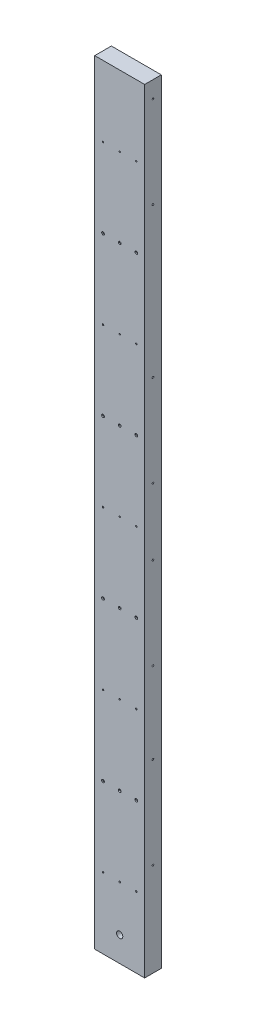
ISO-10303-21;
HEADER;
FILE_DESCRIPTION(('STEP AP214'),'2;1');
FILE_NAME('part.step','',(''),(''),'','','');
FILE_SCHEMA(('AUTOMOTIVE_DESIGN { 1 0 10303 214 1 1 1 1 }'));
ENDSEC;
DATA;
#1=APPLICATION_CONTEXT('core data for automotive mechanical design processes');
#2=APPLICATION_PROTOCOL_DEFINITION('international standard','automotive_design',2000,#1);
#3=PRODUCT_CONTEXT('',#1,'mechanical');
#4=PRODUCT('Part','Part','',(#3));
#5=PRODUCT_RELATED_PRODUCT_CATEGORY('part','',(#4));
#6=PRODUCT_DEFINITION_FORMATION('','',#4);
#7=PRODUCT_DEFINITION_CONTEXT('part definition',#1,'design');
#8=PRODUCT_DEFINITION('design','',#6,#7);
#9=PRODUCT_DEFINITION_SHAPE('','',#8);
#10=(LENGTH_UNIT() NAMED_UNIT(*) SI_UNIT(.MILLI.,.METRE.));
#11=(NAMED_UNIT(*) PLANE_ANGLE_UNIT() SI_UNIT($,.RADIAN.));
#12=(NAMED_UNIT(*) SI_UNIT($,.STERADIAN.) SOLID_ANGLE_UNIT());
#13=UNCERTAINTY_MEASURE_WITH_UNIT(LENGTH_MEASURE(1.E-05),#10,'distance_accuracy_value','');
#14=(GEOMETRIC_REPRESENTATION_CONTEXT(3) GLOBAL_UNCERTAINTY_ASSIGNED_CONTEXT((#13)) GLOBAL_UNIT_ASSIGNED_CONTEXT((#10,
#11,#12)) REPRESENTATION_CONTEXT('',''));
#15=CARTESIAN_POINT('',(0.,0.,0.));
#16=DIRECTION('',(0.,0.,1.));
#17=DIRECTION('',(1.,0.,0.));
#18=AXIS2_PLACEMENT_3D('',#15,#16,#17);
#19=CARTESIAN_POINT('',(-76.2,2362.2,-25.4));
#20=DIRECTION('',(0.,0.,1.));
#21=DIRECTION('',(1.,0.,0.));
#22=AXIS2_PLACEMENT_3D('',#19,#20,#21);
#23=PLANE('',#22);
#24=CARTESIAN_POINT('',(50.8,2146.3,-25.4));
#25=DIRECTION('',(0.,0.,-1.));
#26=DIRECTION('',(-1.,0.,0.));
#27=AXIS2_PLACEMENT_3D('',#24,#25,#26);
#28=CIRCLE('',#27,4.2164);
#29=CARTESIAN_POINT('',(46.5836,2146.3,-25.4));
#30=VERTEX_POINT('',#29);
#31=EDGE_CURVE('E162',#30,#30,#28,.T.);
#32=ORIENTED_EDGE('',*,*,#31,.F.);
#33=EDGE_LOOP('',(#32));
#34=FACE_BOUND('',#33,.T.);
#35=CARTESIAN_POINT('',(0.,2146.3,-25.4));
#36=DIRECTION('',(0.,0.,-1.));
#37=DIRECTION('',(-1.,0.,0.));
#38=AXIS2_PLACEMENT_3D('',#35,#36,#37);
#39=CIRCLE('',#38,4.2164);
#40=CARTESIAN_POINT('',(-4.2164,2146.3,-25.4));
#41=VERTEX_POINT('',#40);
#42=EDGE_CURVE('E171',#41,#41,#39,.T.);
#43=ORIENTED_EDGE('',*,*,#42,.F.);
#44=EDGE_LOOP('',(#43));
#45=FACE_BOUND('',#44,.T.);
#46=CARTESIAN_POINT('',(-50.8,2146.3,-25.4));
#47=DIRECTION('',(0.,0.,-1.));
#48=DIRECTION('',(-1.,0.,0.));
#49=AXIS2_PLACEMENT_3D('',#46,#47,#48);
#50=CIRCLE('',#49,4.2164);
#51=CARTESIAN_POINT('',(-55.0164,2146.3,-25.4));
#52=VERTEX_POINT('',#51);
#53=EDGE_CURVE('E180',#52,#52,#50,.T.);
#54=ORIENTED_EDGE('',*,*,#53,.F.);
#55=EDGE_LOOP('',(#54));
#56=FACE_BOUND('',#55,.T.);
#57=CARTESIAN_POINT('',(50.8,1663.7,-25.4));
#58=DIRECTION('',(0.,0.,-1.));
#59=DIRECTION('',(-1.,0.,0.));
#60=AXIS2_PLACEMENT_3D('',#57,#58,#59);
#61=CIRCLE('',#60,4.2164);
#62=CARTESIAN_POINT('',(46.5836,1663.7,-25.4));
#63=VERTEX_POINT('',#62);
#64=EDGE_CURVE('E189',#63,#63,#61,.T.);
#65=ORIENTED_EDGE('',*,*,#64,.F.);
#66=EDGE_LOOP('',(#65));
#67=FACE_BOUND('',#66,.T.);
#68=CARTESIAN_POINT('',(0.,1663.7,-25.4));
#69=DIRECTION('',(0.,0.,-1.));
#70=DIRECTION('',(-1.,0.,0.));
#71=AXIS2_PLACEMENT_3D('',#68,#69,#70);
#72=CIRCLE('',#71,4.2164);
#73=CARTESIAN_POINT('',(-4.2164,1663.7,-25.4));
#74=VERTEX_POINT('',#73);
#75=EDGE_CURVE('E198',#74,#74,#72,.T.);
#76=ORIENTED_EDGE('',*,*,#75,.F.);
#77=EDGE_LOOP('',(#76));
#78=FACE_BOUND('',#77,.T.);
#79=CARTESIAN_POINT('',(-50.8000000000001,1663.7,-25.4));
#80=DIRECTION('',(0.,0.,-1.));
#81=DIRECTION('',(-1.,0.,0.));
#82=AXIS2_PLACEMENT_3D('',#79,#80,#81);
#83=CIRCLE('',#82,4.2164);
#84=CARTESIAN_POINT('',(-55.0164000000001,1663.7,-25.4));
#85=VERTEX_POINT('',#84);
#86=EDGE_CURVE('E207',#85,#85,#83,.T.);
#87=ORIENTED_EDGE('',*,*,#86,.F.);
#88=EDGE_LOOP('',(#87));
#89=FACE_BOUND('',#88,.T.);
#90=CARTESIAN_POINT('',(50.8,1181.1,-25.4));
#91=DIRECTION('',(0.,0.,-1.));
#92=DIRECTION('',(-1.,0.,0.));
#93=AXIS2_PLACEMENT_3D('',#90,#91,#92);
#94=CIRCLE('',#93,4.2164);
#95=CARTESIAN_POINT('',(46.5836,1181.1,-25.4));
#96=VERTEX_POINT('',#95);
#97=EDGE_CURVE('E216',#96,#96,#94,.T.);
#98=ORIENTED_EDGE('',*,*,#97,.F.);
#99=EDGE_LOOP('',(#98));
#100=FACE_BOUND('',#99,.T.);
#101=CARTESIAN_POINT('',(0.,1181.1,-25.4));
#102=DIRECTION('',(0.,0.,-1.));
#103=DIRECTION('',(-1.,0.,0.));
#104=AXIS2_PLACEMENT_3D('',#101,#102,#103);
#105=CIRCLE('',#104,4.2164);
#106=CARTESIAN_POINT('',(-4.2164,1181.1,-25.4));
#107=VERTEX_POINT('',#106);
#108=EDGE_CURVE('E225',#107,#107,#105,.T.);
#109=ORIENTED_EDGE('',*,*,#108,.F.);
#110=EDGE_LOOP('',(#109));
#111=FACE_BOUND('',#110,.T.);
#112=CARTESIAN_POINT('',(-50.8000000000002,1181.1,-25.4));
#113=DIRECTION('',(0.,0.,-1.));
#114=DIRECTION('',(-1.,0.,0.));
#115=AXIS2_PLACEMENT_3D('',#112,#113,#114);
#116=CIRCLE('',#115,4.2164);
#117=CARTESIAN_POINT('',(-55.0164000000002,1181.1,-25.4));
#118=VERTEX_POINT('',#117);
#119=EDGE_CURVE('E234',#118,#118,#116,.T.);
#120=ORIENTED_EDGE('',*,*,#119,.F.);
#121=EDGE_LOOP('',(#120));
#122=FACE_BOUND('',#121,.T.);
#123=CARTESIAN_POINT('',(50.8,698.5,-25.4));
#124=DIRECTION('',(0.,0.,-1.));
#125=DIRECTION('',(-1.,0.,0.));
#126=AXIS2_PLACEMENT_3D('',#123,#124,#125);
#127=CIRCLE('',#126,4.2164);
#128=CARTESIAN_POINT('',(46.5836,698.5,-25.4));
#129=VERTEX_POINT('',#128);
#130=EDGE_CURVE('E243',#129,#129,#127,.T.);
#131=ORIENTED_EDGE('',*,*,#130,.F.);
#132=EDGE_LOOP('',(#131));
#133=FACE_BOUND('',#132,.T.);
#134=CARTESIAN_POINT('',(-50.8000000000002,698.5,-25.4));
#135=DIRECTION('',(0.,0.,-1.));
#136=DIRECTION('',(-1.,0.,0.));
#137=AXIS2_PLACEMENT_3D('',#134,#135,#136);
#138=CIRCLE('',#137,4.2164);
#139=CARTESIAN_POINT('',(-55.0164000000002,698.5,-25.4));
#140=VERTEX_POINT('',#139);
#141=EDGE_CURVE('E261',#140,#140,#138,.T.);
#142=ORIENTED_EDGE('',*,*,#141,.F.);
#143=EDGE_LOOP('',(#142));
#144=FACE_BOUND('',#143,.T.);
#145=CARTESIAN_POINT('',(50.8,215.9,-25.4));
#146=DIRECTION('',(0.,0.,-1.));
#147=DIRECTION('',(-1.,0.,0.));
#148=AXIS2_PLACEMENT_3D('',#145,#146,#147);
#149=CIRCLE('',#148,4.2164);
#150=CARTESIAN_POINT('',(46.5836,215.9,-25.4));
#151=VERTEX_POINT('',#150);
#152=EDGE_CURVE('E270',#151,#151,#149,.T.);
#153=ORIENTED_EDGE('',*,*,#152,.F.);
#154=EDGE_LOOP('',(#153));
#155=FACE_BOUND('',#154,.T.);
#156=CARTESIAN_POINT('',(0.,215.9,-25.4));
#157=DIRECTION('',(0.,0.,-1.));
#158=DIRECTION('',(-1.,0.,0.));
#159=AXIS2_PLACEMENT_3D('',#156,#157,#158);
#160=CIRCLE('',#159,4.2164);
#161=CARTESIAN_POINT('',(-4.2164,215.9,-25.4));
#162=VERTEX_POINT('',#161);
#163=EDGE_CURVE('E279',#162,#162,#160,.T.);
#164=ORIENTED_EDGE('',*,*,#163,.F.);
#165=EDGE_LOOP('',(#164));
#166=FACE_BOUND('',#165,.T.);
#167=CARTESIAN_POINT('',(-50.8000000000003,215.9,-25.4));
#168=DIRECTION('',(0.,0.,-1.));
#169=DIRECTION('',(-1.,0.,0.));
#170=AXIS2_PLACEMENT_3D('',#167,#168,#169);
#171=CIRCLE('',#170,4.2164);
#172=CARTESIAN_POINT('',(-55.0164000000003,215.9,-25.4));
#173=VERTEX_POINT('',#172);
#174=EDGE_CURVE('E288',#173,#173,#171,.T.);
#175=ORIENTED_EDGE('',*,*,#174,.F.);
#176=EDGE_LOOP('',(#175));
#177=FACE_BOUND('',#176,.T.);
#178=CARTESIAN_POINT('',(50.8000000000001,1905.,-25.4));
#179=DIRECTION('',(0.,0.,1.));
#180=DIRECTION('',(1.,0.,0.));
#181=AXIS2_PLACEMENT_3D('',#178,#179,#180);
#182=CIRCLE('',#181,2.24789999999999);
#183=CARTESIAN_POINT('',(53.0479,1905.,-25.4));
#184=VERTEX_POINT('',#183);
#185=EDGE_CURVE('E303',#184,#184,#182,.T.);
#186=ORIENTED_EDGE('',*,*,#185,.T.);
#187=EDGE_LOOP('',(#186));
#188=FACE_BOUND('',#187,.T.);
#189=CARTESIAN_POINT('',(0.,1905.,-25.4));
#190=DIRECTION('',(0.,0.,1.));
#191=DIRECTION('',(1.,0.,0.));
#192=AXIS2_PLACEMENT_3D('',#189,#190,#191);
#193=CIRCLE('',#192,2.24789999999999);
#194=CARTESIAN_POINT('',(2.24790000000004,1905.,-25.4));
#195=VERTEX_POINT('',#194);
#196=EDGE_CURVE('E312',#195,#195,#193,.T.);
#197=ORIENTED_EDGE('',*,*,#196,.T.);
#198=EDGE_LOOP('',(#197));
#199=FACE_BOUND('',#198,.T.);
#200=CARTESIAN_POINT('',(-50.8,1905.,-25.4));
#201=DIRECTION('',(0.,0.,1.));
#202=DIRECTION('',(1.,0.,0.));
#203=AXIS2_PLACEMENT_3D('',#200,#201,#202);
#204=CIRCLE('',#203,2.24789999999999);
#205=CARTESIAN_POINT('',(-48.5521,1905.,-25.4));
#206=VERTEX_POINT('',#205);
#207=EDGE_CURVE('E321',#206,#206,#204,.T.);
#208=ORIENTED_EDGE('',*,*,#207,.T.);
#209=EDGE_LOOP('',(#208));
#210=FACE_BOUND('',#209,.T.);
#211=CARTESIAN_POINT('',(50.8000000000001,1422.4,-25.4));
#212=DIRECTION('',(0.,0.,1.));
#213=DIRECTION('',(1.,0.,0.));
#214=AXIS2_PLACEMENT_3D('',#211,#212,#213);
#215=CIRCLE('',#214,2.24789999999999);
#216=CARTESIAN_POINT('',(53.0479000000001,1422.4,-25.4));
#217=VERTEX_POINT('',#216);
#218=EDGE_CURVE('E330',#217,#217,#215,.T.);
#219=ORIENTED_EDGE('',*,*,#218,.T.);
#220=EDGE_LOOP('',(#219));
#221=FACE_BOUND('',#220,.T.);
#222=CARTESIAN_POINT('',(1.11022302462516E-13,1422.4,-25.4));
#223=DIRECTION('',(0.,0.,1.));
#224=DIRECTION('',(1.,0.,0.));
#225=AXIS2_PLACEMENT_3D('',#222,#223,#224);
#226=CIRCLE('',#225,2.24789999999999);
#227=CARTESIAN_POINT('',(2.2479000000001,1422.4,-25.4));
#228=VERTEX_POINT('',#227);
#229=EDGE_CURVE('E339',#228,#228,#226,.T.);
#230=ORIENTED_EDGE('',*,*,#229,.T.);
#231=EDGE_LOOP('',(#230));
#232=FACE_BOUND('',#231,.T.);
#233=CARTESIAN_POINT('',(-50.8,1422.4,-25.4));
#234=DIRECTION('',(0.,0.,1.));
#235=DIRECTION('',(1.,0.,0.));
#236=AXIS2_PLACEMENT_3D('',#233,#234,#235);
#237=CIRCLE('',#236,2.24789999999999);
#238=CARTESIAN_POINT('',(-48.5521,1422.4,-25.4));
#239=VERTEX_POINT('',#238);
#240=EDGE_CURVE('E348',#239,#239,#237,.T.);
#241=ORIENTED_EDGE('',*,*,#240,.T.);
#242=EDGE_LOOP('',(#241));
#243=FACE_BOUND('',#242,.T.);
#244=CARTESIAN_POINT('',(50.8000000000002,939.8,-25.4));
#245=DIRECTION('',(0.,0.,1.));
#246=DIRECTION('',(1.,0.,0.));
#247=AXIS2_PLACEMENT_3D('',#244,#245,#246);
#248=CIRCLE('',#247,2.24789999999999);
#249=CARTESIAN_POINT('',(53.0479000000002,939.8,-25.4));
#250=VERTEX_POINT('',#249);
#251=EDGE_CURVE('E357',#250,#250,#248,.T.);
#252=ORIENTED_EDGE('',*,*,#251,.T.);
#253=EDGE_LOOP('',(#252));
#254=FACE_BOUND('',#253,.T.);
#255=CARTESIAN_POINT('',(1.7419376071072E-13,939.8,-25.4));
#256=DIRECTION('',(0.,0.,1.));
#257=DIRECTION('',(1.,0.,0.));
#258=AXIS2_PLACEMENT_3D('',#255,#256,#257);
#259=CIRCLE('',#258,2.24789999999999);
#260=CARTESIAN_POINT('',(2.24790000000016,939.8,-25.4));
#261=VERTEX_POINT('',#260);
#262=EDGE_CURVE('E366',#261,#261,#259,.T.);
#263=ORIENTED_EDGE('',*,*,#262,.T.);
#264=EDGE_LOOP('',(#263));
#265=FACE_BOUND('',#264,.T.);
#266=CARTESIAN_POINT('',(-50.8,939.8,-25.4));
#267=DIRECTION('',(0.,0.,1.));
#268=DIRECTION('',(1.,0.,0.));
#269=AXIS2_PLACEMENT_3D('',#266,#267,#268);
#270=CIRCLE('',#269,2.24789999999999);
#271=CARTESIAN_POINT('',(-48.5521,939.8,-25.4));
#272=VERTEX_POINT('',#271);
#273=EDGE_CURVE('E375',#272,#272,#270,.T.);
#274=ORIENTED_EDGE('',*,*,#273,.T.);
#275=EDGE_LOOP('',(#274));
#276=FACE_BOUND('',#275,.T.);
#277=CARTESIAN_POINT('',(50.8000000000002,457.2,-25.4));
#278=DIRECTION('',(0.,0.,1.));
#279=DIRECTION('',(1.,0.,0.));
#280=AXIS2_PLACEMENT_3D('',#277,#278,#279);
#281=CIRCLE('',#280,2.24789999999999);
#282=CARTESIAN_POINT('',(53.0479000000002,457.2,-25.4));
#283=VERTEX_POINT('',#282);
#284=EDGE_CURVE('E384',#283,#283,#281,.T.);
#285=ORIENTED_EDGE('',*,*,#284,.T.);
#286=EDGE_LOOP('',(#285));
#287=FACE_BOUND('',#286,.T.);
#288=CARTESIAN_POINT('',(2.35922392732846E-13,457.2,-25.4));
#289=DIRECTION('',(0.,0.,1.));
#290=DIRECTION('',(1.,0.,0.));
#291=AXIS2_PLACEMENT_3D('',#288,#289,#290);
#292=CIRCLE('',#291,2.24789999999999);
#293=CARTESIAN_POINT('',(2.24790000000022,457.2,-25.4));
#294=VERTEX_POINT('',#293);
#295=EDGE_CURVE('E393',#294,#294,#292,.T.);
#296=ORIENTED_EDGE('',*,*,#295,.T.);
#297=EDGE_LOOP('',(#296));
#298=FACE_BOUND('',#297,.T.);
#299=CARTESIAN_POINT('',(-50.8,457.2,-25.4));
#300=DIRECTION('',(0.,0.,1.));
#301=DIRECTION('',(1.,0.,0.));
#302=AXIS2_PLACEMENT_3D('',#299,#300,#301);
#303=CIRCLE('',#302,2.24789999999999);
#304=CARTESIAN_POINT('',(-48.5521,457.2,-25.4));
#305=VERTEX_POINT('',#304);
#306=EDGE_CURVE('E402',#305,#305,#303,.T.);
#307=ORIENTED_EDGE('',*,*,#306,.T.);
#308=EDGE_LOOP('',(#307));
#309=FACE_BOUND('',#308,.T.);
#310=CARTESIAN_POINT('',(0.,76.2,-25.4));
#311=DIRECTION('',(0.,0.,-1.));
#312=DIRECTION('',(-1.,0.,0.));
#313=AXIS2_PLACEMENT_3D('',#310,#311,#312);
#314=CIRCLE('',#313,9.525);
#315=CARTESIAN_POINT('',(-9.52500000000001,76.2,-25.4));
#316=VERTEX_POINT('',#315);
#317=EDGE_CURVE('E405',#316,#316,#314,.T.);
#318=ORIENTED_EDGE('',*,*,#317,.F.);
#319=EDGE_LOOP('',(#318));
#320=FACE_BOUND('',#319,.T.);
#321=DIRECTION('',(-1.,0.,0.));
#322=VECTOR('',#321,1.);
#323=CARTESIAN_POINT('',(-76.2,0.,-25.4));
#324=LINE('',#323,#322);
#325=CARTESIAN_POINT('',(76.2,0.,-25.4));
#326=VERTEX_POINT('',#325);
#327=CARTESIAN_POINT('',(-76.2,0.,-25.4));
#328=VERTEX_POINT('',#327);
#329=EDGE_CURVE('E421',#326,#328,#324,.T.);
#330=ORIENTED_EDGE('',*,*,#329,.T.);
#331=DIRECTION('',(0.,-1.,0.));
#332=VECTOR('',#331,1.);
#333=CARTESIAN_POINT('',(-76.2,2362.2,-25.4));
#334=LINE('',#333,#332);
#335=CARTESIAN_POINT('',(-76.2,2362.2,-25.4));
#336=VERTEX_POINT('',#335);
#337=EDGE_CURVE('E41',#336,#328,#334,.T.);
#338=ORIENTED_EDGE('',*,*,#337,.F.);
#339=DIRECTION('',(-1.,0.,0.));
#340=VECTOR('',#339,1.);
#341=CARTESIAN_POINT('',(-76.2,2362.2,-25.4));
#342=LINE('',#341,#340);
#343=CARTESIAN_POINT('',(76.2,2362.2,-25.4));
#344=VERTEX_POINT('',#343);
#345=EDGE_CURVE('E80',#344,#336,#342,.T.);
#346=ORIENTED_EDGE('',*,*,#345,.F.);
#347=DIRECTION('',(0.,-1.,0.));
#348=VECTOR('',#347,1.);
#349=CARTESIAN_POINT('',(76.2,2362.2,-25.4));
#350=LINE('',#349,#348);
#351=EDGE_CURVE('E11',#344,#326,#350,.T.);
#352=ORIENTED_EDGE('',*,*,#351,.T.);
#353=EDGE_LOOP('',(#330,#338,#346,#352));
#354=FACE_BOUND('',#353,.T.);
#355=CARTESIAN_POINT('',(0.,698.5,-25.4));
#356=DIRECTION('',(0.,0.,-1.));
#357=DIRECTION('',(-1.,0.,0.));
#358=AXIS2_PLACEMENT_3D('',#355,#356,#357);
#359=CIRCLE('',#358,4.2164);
#360=CARTESIAN_POINT('',(-4.2164,698.5,-25.4));
#361=VERTEX_POINT('',#360);
#362=EDGE_CURVE('E252',#361,#361,#359,.T.);
#363=ORIENTED_EDGE('',*,*,#362,.F.);
#364=EDGE_LOOP('',(#363));
#365=FACE_BOUND('',#364,.T.);
#366=ADVANCED_FACE('F32',(#34,#45,#56,#67,#78,#89,#100,#111,#122,#133,#144,#155,#166,#177,#188,
#199,#210,#221,#232,#243,#254,#265,#276,#287,#298,#309,#320,#354,#365),#23,.F.);
#367=CARTESIAN_POINT('',(76.2,2362.2,-25.4));
#368=DIRECTION('',(-1.,0.,0.));
#369=DIRECTION('',(0.,0.,1.));
#370=AXIS2_PLACEMENT_3D('',#367,#368,#369);
#371=PLANE('',#370);
#372=CARTESIAN_POINT('',(76.2,285.750000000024,-6.88338275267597E-12));
#373=DIRECTION('',(1.,0.,0.));
#374=DIRECTION('',(0.,0.,-1.));
#375=AXIS2_PLACEMENT_3D('',#372,#373,#374);
#376=CIRCLE('',#375,2.52730000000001);
#377=CARTESIAN_POINT('',(76.2,285.750000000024,-2.52730000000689));
#378=VERTEX_POINT('',#377);
#379=EDGE_CURVE('E116',#378,#378,#376,.T.);
#380=ORIENTED_EDGE('',*,*,#379,.F.);
#381=EDGE_LOOP('',(#380));
#382=FACE_BOUND('',#381,.T.);
#383=CARTESIAN_POINT('',(76.2,565.150000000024,-6.88338275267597E-12));
#384=DIRECTION('',(1.,0.,0.));
#385=DIRECTION('',(0.,0.,-1.));
#386=AXIS2_PLACEMENT_3D('',#383,#384,#385);
#387=CIRCLE('',#386,2.52730000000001);
#388=CARTESIAN_POINT('',(76.2,565.150000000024,-2.52730000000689));
#389=VERTEX_POINT('',#388);
#390=EDGE_CURVE('E115',#389,#389,#387,.T.);
#391=ORIENTED_EDGE('',*,*,#390,.F.);
#392=EDGE_LOOP('',(#391));
#393=FACE_BOUND('',#392,.T.);
#394=CARTESIAN_POINT('',(76.2,812.800000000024,-6.88338275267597E-12));
#395=DIRECTION('',(1.,0.,0.));
#396=DIRECTION('',(0.,0.,-1.));
#397=AXIS2_PLACEMENT_3D('',#394,#395,#396);
#398=CIRCLE('',#397,2.52730000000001);
#399=CARTESIAN_POINT('',(76.2,812.800000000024,-2.52730000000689));
#400=VERTEX_POINT('',#399);
#401=EDGE_CURVE('E126',#400,#400,#398,.T.);
#402=ORIENTED_EDGE('',*,*,#401,.F.);
#403=EDGE_LOOP('',(#402));
#404=FACE_BOUND('',#403,.T.);
#405=CARTESIAN_POINT('',(76.2,1092.20000000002,-6.88338275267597E-12));
#406=DIRECTION('',(1.,0.,0.));
#407=DIRECTION('',(0.,0.,-1.));
#408=AXIS2_PLACEMENT_3D('',#405,#406,#407);
#409=CIRCLE('',#408,2.5272999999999);
#410=CARTESIAN_POINT('',(76.2,1092.20000000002,-2.52730000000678));
#411=VERTEX_POINT('',#410);
#412=EDGE_CURVE('E132',#411,#411,#409,.T.);
#413=ORIENTED_EDGE('',*,*,#412,.F.);
#414=EDGE_LOOP('',(#413));
#415=FACE_BOUND('',#414,.T.);
#416=CARTESIAN_POINT('',(76.2,2311.40000000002,-6.43929354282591E-12));
#417=DIRECTION('',(1.,0.,0.));
#418=DIRECTION('',(0.,0.,-1.));
#419=AXIS2_PLACEMENT_3D('',#416,#417,#418);
#420=CIRCLE('',#419,2.52730000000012);
#421=CARTESIAN_POINT('',(76.2,2311.40000000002,-2.52730000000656));
#422=VERTEX_POINT('',#421);
#423=EDGE_CURVE('E138',#422,#422,#420,.T.);
#424=ORIENTED_EDGE('',*,*,#423,.F.);
#425=EDGE_LOOP('',(#424));
#426=FACE_BOUND('',#425,.T.);
#427=CARTESIAN_POINT('',(76.2,2032.00000000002,-6.43929354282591E-12));
#428=DIRECTION('',(1.,0.,0.));
#429=DIRECTION('',(0.,0.,-1.));
#430=AXIS2_PLACEMENT_3D('',#427,#428,#429);
#431=CIRCLE('',#430,2.52730000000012);
#432=CARTESIAN_POINT('',(76.2,2032.00000000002,-2.52730000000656));
#433=VERTEX_POINT('',#432);
#434=EDGE_CURVE('E144',#433,#433,#431,.T.);
#435=ORIENTED_EDGE('',*,*,#434,.F.);
#436=EDGE_LOOP('',(#435));
#437=FACE_BOUND('',#436,.T.);
#438=CARTESIAN_POINT('',(76.2,1574.80000000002,-6.43929354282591E-12));
#439=DIRECTION('',(1.,0.,0.));
#440=DIRECTION('',(0.,0.,-1.));
#441=AXIS2_PLACEMENT_3D('',#438,#439,#440);
#442=CIRCLE('',#441,2.5272999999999);
#443=CARTESIAN_POINT('',(76.2,1574.80000000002,-2.52730000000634));
#444=VERTEX_POINT('',#443);
#445=EDGE_CURVE('E150',#444,#444,#442,.T.);
#446=ORIENTED_EDGE('',*,*,#445,.F.);
#447=EDGE_LOOP('',(#446));
#448=FACE_BOUND('',#447,.T.);
#449=CARTESIAN_POINT('',(76.2,1295.40000000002,-6.43929354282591E-12));
#450=DIRECTION('',(1.,0.,0.));
#451=DIRECTION('',(0.,0.,-1.));
#452=AXIS2_PLACEMENT_3D('',#449,#450,#451);
#453=CIRCLE('',#452,2.5272999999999);
#454=CARTESIAN_POINT('',(76.2,1295.40000000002,-2.52730000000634));
#455=VERTEX_POINT('',#454);
#456=EDGE_CURVE('E156',#455,#455,#453,.T.);
#457=ORIENTED_EDGE('',*,*,#456,.F.);
#458=EDGE_LOOP('',(#457));
#459=FACE_BOUND('',#458,.T.);
#460=DIRECTION('',(0.,0.,-1.));
#461=VECTOR('',#460,1.);
#462=CARTESIAN_POINT('',(76.2,0.,-25.4));
#463=LINE('',#462,#461);
#464=CARTESIAN_POINT('',(76.2,0.,25.4));
#465=VERTEX_POINT('',#464);
#466=EDGE_CURVE('E411',#465,#326,#463,.T.);
#467=ORIENTED_EDGE('',*,*,#466,.T.);
#468=ORIENTED_EDGE('',*,*,#351,.F.);
#469=DIRECTION('',(0.,0.,-1.));
#470=VECTOR('',#469,1.);
#471=CARTESIAN_POINT('',(76.2,2362.2,-25.4));
#472=LINE('',#471,#470);
#473=CARTESIAN_POINT('',(76.2,2362.2,25.4));
#474=VERTEX_POINT('',#473);
#475=EDGE_CURVE('E412',#474,#344,#472,.T.);
#476=ORIENTED_EDGE('',*,*,#475,.F.);
#477=DIRECTION('',(0.,-1.,0.));
#478=VECTOR('',#477,1.);
#479=CARTESIAN_POINT('',(76.2,2362.2,25.4));
#480=LINE('',#479,#478);
#481=EDGE_CURVE('E418',#474,#465,#480,.T.);
#482=ORIENTED_EDGE('',*,*,#481,.T.);
#483=EDGE_LOOP('',(#467,#468,#476,#482));
#484=FACE_BOUND('',#483,.T.);
#485=ADVANCED_FACE('F34',(#382,#393,#404,#415,#426,#437,#448,#459,#484),#371,.F.);
#486=CARTESIAN_POINT('',(-76.2,2362.2,-25.4));
#487=DIRECTION('',(1.,0.,0.));
#488=DIRECTION('',(0.,0.,-1.));
#489=AXIS2_PLACEMENT_3D('',#486,#487,#488);
#490=PLANE('',#489);
#491=DIRECTION('',(0.,0.,1.));
#492=VECTOR('',#491,1.);
#493=CARTESIAN_POINT('',(-76.2,0.,-25.4));
#494=LINE('',#493,#492);
#495=CARTESIAN_POINT('',(-76.2,0.,25.4));
#496=VERTEX_POINT('',#495);
#497=EDGE_CURVE('E67',#328,#496,#494,.T.);
#498=ORIENTED_EDGE('',*,*,#497,.T.);
#499=DIRECTION('',(0.,-1.,0.));
#500=VECTOR('',#499,1.);
#501=CARTESIAN_POINT('',(-76.2,2362.2,25.4));
#502=LINE('',#501,#500);
#503=CARTESIAN_POINT('',(-76.2,2362.2,25.4));
#504=VERTEX_POINT('',#503);
#505=EDGE_CURVE('E426',#504,#496,#502,.T.);
#506=ORIENTED_EDGE('',*,*,#505,.F.);
#507=DIRECTION('',(0.,0.,1.));
#508=VECTOR('',#507,1.);
#509=CARTESIAN_POINT('',(-76.2,2362.2,-25.4));
#510=LINE('',#509,#508);
#511=EDGE_CURVE('E415',#336,#504,#510,.T.);
#512=ORIENTED_EDGE('',*,*,#511,.F.);
#513=ORIENTED_EDGE('',*,*,#337,.T.);
#514=EDGE_LOOP('',(#498,#506,#512,#513));
#515=FACE_BOUND('',#514,.T.);
#516=ADVANCED_FACE('F428',(#515),#490,.F.);
#517=CARTESIAN_POINT('',(-76.2,2362.2,25.4));
#518=DIRECTION('',(0.,0.,-1.));
#519=DIRECTION('',(-1.,0.,0.));
#520=AXIS2_PLACEMENT_3D('',#517,#518,#519);
#521=PLANE('',#520);
#522=CARTESIAN_POINT('',(50.8,2146.3,25.4));
#523=DIRECTION('',(0.,0.,-1.));
#524=DIRECTION('',(-1.,0.,0.));
#525=AXIS2_PLACEMENT_3D('',#522,#523,#524);
#526=CIRCLE('',#525,2.24789999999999);
#527=CARTESIAN_POINT('',(48.5521,2146.3,25.4));
#528=VERTEX_POINT('',#527);
#529=EDGE_CURVE('E168',#528,#528,#526,.T.);
#530=ORIENTED_EDGE('',*,*,#529,.T.);
#531=EDGE_LOOP('',(#530));
#532=FACE_BOUND('',#531,.T.);
#533=CARTESIAN_POINT('',(0.,2146.3,25.4));
#534=DIRECTION('',(0.,0.,-1.));
#535=DIRECTION('',(-1.,0.,0.));
#536=AXIS2_PLACEMENT_3D('',#533,#534,#535);
#537=CIRCLE('',#536,2.24789999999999);
#538=CARTESIAN_POINT('',(-2.24789999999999,2146.3,25.4));
#539=VERTEX_POINT('',#538);
#540=EDGE_CURVE('E177',#539,#539,#537,.T.);
#541=ORIENTED_EDGE('',*,*,#540,.T.);
#542=EDGE_LOOP('',(#541));
#543=FACE_BOUND('',#542,.T.);
#544=CARTESIAN_POINT('',(-50.8,2146.3,25.4));
#545=DIRECTION('',(0.,0.,-1.));
#546=DIRECTION('',(-1.,0.,0.));
#547=AXIS2_PLACEMENT_3D('',#544,#545,#546);
#548=CIRCLE('',#547,2.24789999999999);
#549=CARTESIAN_POINT('',(-53.0479,2146.3,25.4));
#550=VERTEX_POINT('',#549);
#551=EDGE_CURVE('E186',#550,#550,#548,.T.);
#552=ORIENTED_EDGE('',*,*,#551,.T.);
#553=EDGE_LOOP('',(#552));
#554=FACE_BOUND('',#553,.T.);
#555=CARTESIAN_POINT('',(50.8,1663.7,25.4));
#556=DIRECTION('',(0.,0.,-1.));
#557=DIRECTION('',(-1.,0.,0.));
#558=AXIS2_PLACEMENT_3D('',#555,#556,#557);
#559=CIRCLE('',#558,2.24789999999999);
#560=CARTESIAN_POINT('',(48.5521,1663.7,25.4));
#561=VERTEX_POINT('',#560);
#562=EDGE_CURVE('E195',#561,#561,#559,.T.);
#563=ORIENTED_EDGE('',*,*,#562,.T.);
#564=EDGE_LOOP('',(#563));
#565=FACE_BOUND('',#564,.T.);
#566=CARTESIAN_POINT('',(0.,1663.7,25.4));
#567=DIRECTION('',(0.,0.,-1.));
#568=DIRECTION('',(-1.,0.,0.));
#569=AXIS2_PLACEMENT_3D('',#566,#567,#568);
#570=CIRCLE('',#569,2.24789999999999);
#571=CARTESIAN_POINT('',(-2.24789999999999,1663.7,25.4));
#572=VERTEX_POINT('',#571);
#573=EDGE_CURVE('E204',#572,#572,#570,.T.);
#574=ORIENTED_EDGE('',*,*,#573,.T.);
#575=EDGE_LOOP('',(#574));
#576=FACE_BOUND('',#575,.T.);
#577=CARTESIAN_POINT('',(-50.8000000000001,1663.7,25.4));
#578=DIRECTION('',(0.,0.,-1.));
#579=DIRECTION('',(-1.,0.,0.));
#580=AXIS2_PLACEMENT_3D('',#577,#578,#579);
#581=CIRCLE('',#580,2.24789999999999);
#582=CARTESIAN_POINT('',(-53.0479000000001,1663.7,25.4));
#583=VERTEX_POINT('',#582);
#584=EDGE_CURVE('E213',#583,#583,#581,.T.);
#585=ORIENTED_EDGE('',*,*,#584,.T.);
#586=EDGE_LOOP('',(#585));
#587=FACE_BOUND('',#586,.T.);
#588=CARTESIAN_POINT('',(50.8,1181.1,25.4));
#589=DIRECTION('',(0.,0.,-1.));
#590=DIRECTION('',(-1.,0.,0.));
#591=AXIS2_PLACEMENT_3D('',#588,#589,#590);
#592=CIRCLE('',#591,2.24789999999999);
#593=CARTESIAN_POINT('',(48.5521,1181.1,25.4));
#594=VERTEX_POINT('',#593);
#595=EDGE_CURVE('E222',#594,#594,#592,.T.);
#596=ORIENTED_EDGE('',*,*,#595,.T.);
#597=EDGE_LOOP('',(#596));
#598=FACE_BOUND('',#597,.T.);
#599=CARTESIAN_POINT('',(0.,1181.1,25.4));
#600=DIRECTION('',(0.,0.,-1.));
#601=DIRECTION('',(-1.,0.,0.));
#602=AXIS2_PLACEMENT_3D('',#599,#600,#601);
#603=CIRCLE('',#602,2.24789999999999);
#604=CARTESIAN_POINT('',(-2.24789999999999,1181.1,25.4));
#605=VERTEX_POINT('',#604);
#606=EDGE_CURVE('E231',#605,#605,#603,.T.);
#607=ORIENTED_EDGE('',*,*,#606,.T.);
#608=EDGE_LOOP('',(#607));
#609=FACE_BOUND('',#608,.T.);
#610=CARTESIAN_POINT('',(-50.8000000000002,1181.1,25.4));
#611=DIRECTION('',(0.,0.,-1.));
#612=DIRECTION('',(-1.,0.,0.));
#613=AXIS2_PLACEMENT_3D('',#610,#611,#612);
#614=CIRCLE('',#613,2.24789999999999);
#615=CARTESIAN_POINT('',(-53.0479000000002,1181.1,25.4));
#616=VERTEX_POINT('',#615);
#617=EDGE_CURVE('E240',#616,#616,#614,.T.);
#618=ORIENTED_EDGE('',*,*,#617,.T.);
#619=EDGE_LOOP('',(#618));
#620=FACE_BOUND('',#619,.T.);
#621=CARTESIAN_POINT('',(50.8,698.5,25.4));
#622=DIRECTION('',(0.,0.,-1.));
#623=DIRECTION('',(-1.,0.,0.));
#624=AXIS2_PLACEMENT_3D('',#621,#622,#623);
#625=CIRCLE('',#624,2.24789999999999);
#626=CARTESIAN_POINT('',(48.5521,698.5,25.4));
#627=VERTEX_POINT('',#626);
#628=EDGE_CURVE('E249',#627,#627,#625,.T.);
#629=ORIENTED_EDGE('',*,*,#628,.T.);
#630=EDGE_LOOP('',(#629));
#631=FACE_BOUND('',#630,.T.);
#632=CARTESIAN_POINT('',(0.,698.5,25.4));
#633=DIRECTION('',(0.,0.,-1.));
#634=DIRECTION('',(-1.,0.,0.));
#635=AXIS2_PLACEMENT_3D('',#632,#633,#634);
#636=CIRCLE('',#635,2.24789999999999);
#637=CARTESIAN_POINT('',(-2.24789999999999,698.5,25.4));
#638=VERTEX_POINT('',#637);
#639=EDGE_CURVE('E258',#638,#638,#636,.T.);
#640=ORIENTED_EDGE('',*,*,#639,.T.);
#641=EDGE_LOOP('',(#640));
#642=FACE_BOUND('',#641,.T.);
#643=CARTESIAN_POINT('',(-50.8000000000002,698.5,25.4));
#644=DIRECTION('',(0.,0.,-1.));
#645=DIRECTION('',(-1.,0.,0.));
#646=AXIS2_PLACEMENT_3D('',#643,#644,#645);
#647=CIRCLE('',#646,2.24789999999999);
#648=CARTESIAN_POINT('',(-53.0479000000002,698.5,25.4));
#649=VERTEX_POINT('',#648);
#650=EDGE_CURVE('E267',#649,#649,#647,.T.);
#651=ORIENTED_EDGE('',*,*,#650,.T.);
#652=EDGE_LOOP('',(#651));
#653=FACE_BOUND('',#652,.T.);
#654=CARTESIAN_POINT('',(50.8,215.9,25.4));
#655=DIRECTION('',(0.,0.,-1.));
#656=DIRECTION('',(-1.,0.,0.));
#657=AXIS2_PLACEMENT_3D('',#654,#655,#656);
#658=CIRCLE('',#657,2.24789999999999);
#659=CARTESIAN_POINT('',(48.5521,215.9,25.4));
#660=VERTEX_POINT('',#659);
#661=EDGE_CURVE('E276',#660,#660,#658,.T.);
#662=ORIENTED_EDGE('',*,*,#661,.T.);
#663=EDGE_LOOP('',(#662));
#664=FACE_BOUND('',#663,.T.);
#665=CARTESIAN_POINT('',(0.,215.9,25.4));
#666=DIRECTION('',(0.,0.,-1.));
#667=DIRECTION('',(-1.,0.,0.));
#668=AXIS2_PLACEMENT_3D('',#665,#666,#667);
#669=CIRCLE('',#668,2.24789999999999);
#670=CARTESIAN_POINT('',(-2.24789999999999,215.9,25.4));
#671=VERTEX_POINT('',#670);
#672=EDGE_CURVE('E285',#671,#671,#669,.T.);
#673=ORIENTED_EDGE('',*,*,#672,.T.);
#674=EDGE_LOOP('',(#673));
#675=FACE_BOUND('',#674,.T.);
#676=CARTESIAN_POINT('',(-50.8000000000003,215.9,25.4));
#677=DIRECTION('',(0.,0.,-1.));
#678=DIRECTION('',(-1.,0.,0.));
#679=AXIS2_PLACEMENT_3D('',#676,#677,#678);
#680=CIRCLE('',#679,2.24789999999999);
#681=CARTESIAN_POINT('',(-53.0479000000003,215.9,25.4));
#682=VERTEX_POINT('',#681);
#683=EDGE_CURVE('E294',#682,#682,#680,.T.);
#684=ORIENTED_EDGE('',*,*,#683,.T.);
#685=EDGE_LOOP('',(#684));
#686=FACE_BOUND('',#685,.T.);
#687=CARTESIAN_POINT('',(50.8000000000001,1905.,25.4));
#688=DIRECTION('',(0.,0.,1.));
#689=DIRECTION('',(1.,0.,0.));
#690=AXIS2_PLACEMENT_3D('',#687,#688,#689);
#691=CIRCLE('',#690,4.2164);
#692=CARTESIAN_POINT('',(55.0164000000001,1905.,25.4));
#693=VERTEX_POINT('',#692);
#694=EDGE_CURVE('E297',#693,#693,#691,.T.);
#695=ORIENTED_EDGE('',*,*,#694,.F.);
#696=EDGE_LOOP('',(#695));
#697=FACE_BOUND('',#696,.T.);
#698=CARTESIAN_POINT('',(0.,1905.,25.4));
#699=DIRECTION('',(0.,0.,1.));
#700=DIRECTION('',(1.,0.,0.));
#701=AXIS2_PLACEMENT_3D('',#698,#699,#700);
#702=CIRCLE('',#701,4.2164);
#703=CARTESIAN_POINT('',(4.21640000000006,1905.,25.4));
#704=VERTEX_POINT('',#703);
#705=EDGE_CURVE('E306',#704,#704,#702,.T.);
#706=ORIENTED_EDGE('',*,*,#705,.F.);
#707=EDGE_LOOP('',(#706));
#708=FACE_BOUND('',#707,.T.);
#709=CARTESIAN_POINT('',(-50.8,1905.,25.4));
#710=DIRECTION('',(0.,0.,1.));
#711=DIRECTION('',(1.,0.,0.));
#712=AXIS2_PLACEMENT_3D('',#709,#710,#711);
#713=CIRCLE('',#712,4.2164);
#714=CARTESIAN_POINT('',(-46.5836,1905.,25.4));
#715=VERTEX_POINT('',#714);
#716=EDGE_CURVE('E315',#715,#715,#713,.T.);
#717=ORIENTED_EDGE('',*,*,#716,.F.);
#718=EDGE_LOOP('',(#717));
#719=FACE_BOUND('',#718,.T.);
#720=CARTESIAN_POINT('',(50.8000000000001,1422.4,25.4));
#721=DIRECTION('',(0.,0.,1.));
#722=DIRECTION('',(1.,0.,0.));
#723=AXIS2_PLACEMENT_3D('',#720,#721,#722);
#724=CIRCLE('',#723,4.2164);
#725=CARTESIAN_POINT('',(55.0164000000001,1422.4,25.4));
#726=VERTEX_POINT('',#725);
#727=EDGE_CURVE('E324',#726,#726,#724,.T.);
#728=ORIENTED_EDGE('',*,*,#727,.F.);
#729=EDGE_LOOP('',(#728));
#730=FACE_BOUND('',#729,.T.);
#731=CARTESIAN_POINT('',(1.11022302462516E-13,1422.4,25.4));
#732=DIRECTION('',(0.,0.,1.));
#733=DIRECTION('',(1.,0.,0.));
#734=AXIS2_PLACEMENT_3D('',#731,#732,#733);
#735=CIRCLE('',#734,4.2164);
#736=CARTESIAN_POINT('',(4.21640000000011,1422.4,25.4));
#737=VERTEX_POINT('',#736);
#738=EDGE_CURVE('E333',#737,#737,#735,.T.);
#739=ORIENTED_EDGE('',*,*,#738,.F.);
#740=EDGE_LOOP('',(#739));
#741=FACE_BOUND('',#740,.T.);
#742=CARTESIAN_POINT('',(-50.8,1422.4,25.4));
#743=DIRECTION('',(0.,0.,1.));
#744=DIRECTION('',(1.,0.,0.));
#745=AXIS2_PLACEMENT_3D('',#742,#743,#744);
#746=CIRCLE('',#745,4.2164);
#747=CARTESIAN_POINT('',(-46.5836,1422.4,25.4));
#748=VERTEX_POINT('',#747);
#749=EDGE_CURVE('E342',#748,#748,#746,.T.);
#750=ORIENTED_EDGE('',*,*,#749,.F.);
#751=EDGE_LOOP('',(#750));
#752=FACE_BOUND('',#751,.T.);
#753=CARTESIAN_POINT('',(50.8000000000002,939.8,25.4));
#754=DIRECTION('',(0.,0.,1.));
#755=DIRECTION('',(1.,0.,0.));
#756=AXIS2_PLACEMENT_3D('',#753,#754,#755);
#757=CIRCLE('',#756,4.2164);
#758=CARTESIAN_POINT('',(55.0164000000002,939.8,25.4));
#759=VERTEX_POINT('',#758);
#760=EDGE_CURVE('E351',#759,#759,#757,.T.);
#761=ORIENTED_EDGE('',*,*,#760,.F.);
#762=EDGE_LOOP('',(#761));
#763=FACE_BOUND('',#762,.T.);
#764=CARTESIAN_POINT('',(1.7419376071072E-13,939.8,25.4));
#765=DIRECTION('',(0.,0.,1.));
#766=DIRECTION('',(1.,0.,0.));
#767=AXIS2_PLACEMENT_3D('',#764,#765,#766);
#768=CIRCLE('',#767,4.2164);
#769=CARTESIAN_POINT('',(4.21640000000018,939.8,25.4));
#770=VERTEX_POINT('',#769);
#771=EDGE_CURVE('E360',#770,#770,#768,.T.);
#772=ORIENTED_EDGE('',*,*,#771,.F.);
#773=EDGE_LOOP('',(#772));
#774=FACE_BOUND('',#773,.T.);
#775=CARTESIAN_POINT('',(-50.8,939.8,25.4));
#776=DIRECTION('',(0.,0.,1.));
#777=DIRECTION('',(1.,0.,0.));
#778=AXIS2_PLACEMENT_3D('',#775,#776,#777);
#779=CIRCLE('',#778,4.2164);
#780=CARTESIAN_POINT('',(-46.5836,939.8,25.4));
#781=VERTEX_POINT('',#780);
#782=EDGE_CURVE('E369',#781,#781,#779,.T.);
#783=ORIENTED_EDGE('',*,*,#782,.F.);
#784=EDGE_LOOP('',(#783));
#785=FACE_BOUND('',#784,.T.);
#786=CARTESIAN_POINT('',(50.8000000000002,457.2,25.4));
#787=DIRECTION('',(0.,0.,1.));
#788=DIRECTION('',(1.,0.,0.));
#789=AXIS2_PLACEMENT_3D('',#786,#787,#788);
#790=CIRCLE('',#789,4.2164);
#791=CARTESIAN_POINT('',(55.0164000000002,457.2,25.4));
#792=VERTEX_POINT('',#791);
#793=EDGE_CURVE('E378',#792,#792,#790,.T.);
#794=ORIENTED_EDGE('',*,*,#793,.F.);
#795=EDGE_LOOP('',(#794));
#796=FACE_BOUND('',#795,.T.);
#797=CARTESIAN_POINT('',(2.35922392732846E-13,457.2,25.4));
#798=DIRECTION('',(0.,0.,1.));
#799=DIRECTION('',(1.,0.,0.));
#800=AXIS2_PLACEMENT_3D('',#797,#798,#799);
#801=CIRCLE('',#800,4.2164);
#802=CARTESIAN_POINT('',(4.21640000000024,457.2,25.4));
#803=VERTEX_POINT('',#802);
#804=EDGE_CURVE('E387',#803,#803,#801,.T.);
#805=ORIENTED_EDGE('',*,*,#804,.F.);
#806=EDGE_LOOP('',(#805));
#807=FACE_BOUND('',#806,.T.);
#808=CARTESIAN_POINT('',(-50.8,457.2,25.4));
#809=DIRECTION('',(0.,0.,1.));
#810=DIRECTION('',(1.,0.,0.));
#811=AXIS2_PLACEMENT_3D('',#808,#809,#810);
#812=CIRCLE('',#811,4.2164);
#813=CARTESIAN_POINT('',(-46.5836,457.2,25.4));
#814=VERTEX_POINT('',#813);
#815=EDGE_CURVE('E396',#814,#814,#812,.T.);
#816=ORIENTED_EDGE('',*,*,#815,.F.);
#817=EDGE_LOOP('',(#816));
#818=FACE_BOUND('',#817,.T.);
#819=CARTESIAN_POINT('',(0.,76.2,25.4));
#820=DIRECTION('',(0.,0.,-1.));
#821=DIRECTION('',(-1.,0.,0.));
#822=AXIS2_PLACEMENT_3D('',#819,#820,#821);
#823=CIRCLE('',#822,9.52499999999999);
#824=CARTESIAN_POINT('',(-9.525,76.2,25.4));
#825=VERTEX_POINT('',#824);
#826=EDGE_CURVE('E408',#825,#825,#823,.T.);
#827=ORIENTED_EDGE('',*,*,#826,.T.);
#828=EDGE_LOOP('',(#827));
#829=FACE_BOUND('',#828,.T.);
#830=DIRECTION('',(1.,0.,0.));
#831=VECTOR('',#830,1.);
#832=CARTESIAN_POINT('',(-76.2,0.,25.4));
#833=LINE('',#832,#831);
#834=EDGE_CURVE('E73',#496,#465,#833,.T.);
#835=ORIENTED_EDGE('',*,*,#834,.T.);
#836=ORIENTED_EDGE('',*,*,#481,.F.);
#837=DIRECTION('',(1.,0.,0.));
#838=VECTOR('',#837,1.);
#839=CARTESIAN_POINT('',(-76.2,2362.2,25.4));
#840=LINE('',#839,#838);
#841=EDGE_CURVE('E49',#504,#474,#840,.T.);
#842=ORIENTED_EDGE('',*,*,#841,.F.);
#843=ORIENTED_EDGE('',*,*,#505,.T.);
#844=EDGE_LOOP('',(#835,#836,#842,#843));
#845=FACE_BOUND('',#844,.T.);
#846=ADVANCED_FACE('F435',(#532,#543,#554,#565,#576,#587,#598,#609,#620,#631,#642,#653,#664,
#675,#686,#697,#708,#719,#730,#741,#752,#763,#774,#785,#796,#807,#818,#829,#845),#521,.F.);
#847=CARTESIAN_POINT('',(0.,2362.2,0.));
#848=DIRECTION('',(0.,1.,0.));
#849=DIRECTION('',(0.,0.,1.));
#850=AXIS2_PLACEMENT_3D('',#847,#848,#849);
#851=PLANE('',#850);
#852=ORIENTED_EDGE('',*,*,#475,.T.);
#853=ORIENTED_EDGE('',*,*,#345,.T.);
#854=ORIENTED_EDGE('',*,*,#511,.T.);
#855=ORIENTED_EDGE('',*,*,#841,.T.);
#856=EDGE_LOOP('',(#852,#853,#854,#855));
#857=FACE_BOUND('',#856,.T.);
#858=ADVANCED_FACE('F437',(#857),#851,.T.);
#859=CARTESIAN_POINT('',(0.,0.,0.));
#860=DIRECTION('',(0.,1.,0.));
#861=DIRECTION('',(0.,0.,1.));
#862=AXIS2_PLACEMENT_3D('',#859,#860,#861);
#863=PLANE('',#862);
#864=ORIENTED_EDGE('',*,*,#466,.F.);
#865=ORIENTED_EDGE('',*,*,#834,.F.);
#866=ORIENTED_EDGE('',*,*,#497,.F.);
#867=ORIENTED_EDGE('',*,*,#329,.F.);
#868=EDGE_LOOP('',(#864,#865,#866,#867));
#869=FACE_BOUND('',#868,.T.);
#870=ADVANCED_FACE('F431',(#869),#863,.F.);
#871=CARTESIAN_POINT('',(0.,76.2,-25.4));
#872=DIRECTION('',(0.,0.,-1.));
#873=DIRECTION('',(-1.,0.,0.));
#874=AXIS2_PLACEMENT_3D('',#871,#872,#873);
#875=CYLINDRICAL_SURFACE('',#874,9.52499999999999);
#876=ORIENTED_EDGE('',*,*,#826,.F.);
#877=EDGE_LOOP('',(#876));
#878=FACE_BOUND('',#877,.T.);
#879=ORIENTED_EDGE('',*,*,#317,.T.);
#880=EDGE_LOOP('',(#879));
#881=FACE_BOUND('',#880,.T.);
#882=ADVANCED_FACE('F655',(#878,#881),#875,.F.);
#883=CARTESIAN_POINT('',(-50.8,457.2,25.4));
#884=DIRECTION('',(0.,0.,1.));
#885=DIRECTION('',(1.,0.,0.));
#886=AXIS2_PLACEMENT_3D('',#883,#884,#885);
#887=CYLINDRICAL_SURFACE('',#886,2.24789999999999);
#888=ORIENTED_EDGE('',*,*,#306,.F.);
#889=EDGE_LOOP('',(#888));
#890=FACE_BOUND('',#889,.T.);
#891=CARTESIAN_POINT('',(-50.8,457.2,23.7482323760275));
#892=DIRECTION('',(0.,0.,1.));
#893=DIRECTION('',(1.,0.,0.));
#894=AXIS2_PLACEMENT_3D('',#891,#892,#893);
#895=CIRCLE('',#894,2.24789999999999);
#896=CARTESIAN_POINT('',(-48.5521,457.2,23.7482323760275));
#897=VERTEX_POINT('',#896);
#898=EDGE_CURVE('E399',#897,#897,#895,.T.);
#899=ORIENTED_EDGE('',*,*,#898,.T.);
#900=EDGE_LOOP('',(#899));
#901=FACE_BOUND('',#900,.T.);
#902=ADVANCED_FACE('F651',(#890,#901),#887,.F.);
#903=CARTESIAN_POINT('',(-50.8,457.2,25.4));
#904=DIRECTION('',(0.,0.,1.));
#905=DIRECTION('',(1.,0.,0.));
#906=AXIS2_PLACEMENT_3D('',#903,#904,#905);
#907=CONICAL_SURFACE('',#906,4.2164,0.87266462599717);
#908=ORIENTED_EDGE('',*,*,#898,.F.);
#909=EDGE_LOOP('',(#908));
#910=FACE_BOUND('',#909,.T.);
#911=ORIENTED_EDGE('',*,*,#815,.T.);
#912=EDGE_LOOP('',(#911));
#913=FACE_BOUND('',#912,.T.);
#914=ADVANCED_FACE('F647',(#910,#913),#907,.F.);
#915=CARTESIAN_POINT('',(2.35922392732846E-13,457.2,25.4));
#916=DIRECTION('',(0.,0.,1.));
#917=DIRECTION('',(1.,0.,0.));
#918=AXIS2_PLACEMENT_3D('',#915,#916,#917);
#919=CYLINDRICAL_SURFACE('',#918,2.24789999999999);
#920=ORIENTED_EDGE('',*,*,#295,.F.);
#921=EDGE_LOOP('',(#920));
#922=FACE_BOUND('',#921,.T.);
#923=CARTESIAN_POINT('',(2.35922392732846E-13,457.2,23.7482323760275));
#924=DIRECTION('',(0.,0.,1.));
#925=DIRECTION('',(1.,0.,0.));
#926=AXIS2_PLACEMENT_3D('',#923,#924,#925);
#927=CIRCLE('',#926,2.24789999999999);
#928=CARTESIAN_POINT('',(2.24790000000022,457.2,23.7482323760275));
#929=VERTEX_POINT('',#928);
#930=EDGE_CURVE('E390',#929,#929,#927,.T.);
#931=ORIENTED_EDGE('',*,*,#930,.T.);
#932=EDGE_LOOP('',(#931));
#933=FACE_BOUND('',#932,.T.);
#934=ADVANCED_FACE('F643',(#922,#933),#919,.F.);
#935=CARTESIAN_POINT('',(2.35922392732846E-13,457.2,25.4));
#936=DIRECTION('',(0.,0.,1.));
#937=DIRECTION('',(1.,0.,0.));
#938=AXIS2_PLACEMENT_3D('',#935,#936,#937);
#939=CONICAL_SURFACE('',#938,4.2164,0.87266462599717);
#940=ORIENTED_EDGE('',*,*,#930,.F.);
#941=EDGE_LOOP('',(#940));
#942=FACE_BOUND('',#941,.T.);
#943=ORIENTED_EDGE('',*,*,#804,.T.);
#944=EDGE_LOOP('',(#943));
#945=FACE_BOUND('',#944,.T.);
#946=ADVANCED_FACE('F639',(#942,#945),#939,.F.);
#947=CARTESIAN_POINT('',(50.8000000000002,457.2,25.4));
#948=DIRECTION('',(0.,0.,1.));
#949=DIRECTION('',(1.,0.,0.));
#950=AXIS2_PLACEMENT_3D('',#947,#948,#949);
#951=CYLINDRICAL_SURFACE('',#950,2.24789999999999);
#952=ORIENTED_EDGE('',*,*,#284,.F.);
#953=EDGE_LOOP('',(#952));
#954=FACE_BOUND('',#953,.T.);
#955=CARTESIAN_POINT('',(50.8000000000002,457.2,23.7482323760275));
#956=DIRECTION('',(0.,0.,1.));
#957=DIRECTION('',(1.,0.,0.));
#958=AXIS2_PLACEMENT_3D('',#955,#956,#957);
#959=CIRCLE('',#958,2.24789999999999);
#960=CARTESIAN_POINT('',(53.0479000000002,457.2,23.7482323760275));
#961=VERTEX_POINT('',#960);
#962=EDGE_CURVE('E381',#961,#961,#959,.T.);
#963=ORIENTED_EDGE('',*,*,#962,.T.);
#964=EDGE_LOOP('',(#963));
#965=FACE_BOUND('',#964,.T.);
#966=ADVANCED_FACE('F635',(#954,#965),#951,.F.);
#967=CARTESIAN_POINT('',(50.8000000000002,457.2,25.4));
#968=DIRECTION('',(0.,0.,1.));
#969=DIRECTION('',(1.,0.,0.));
#970=AXIS2_PLACEMENT_3D('',#967,#968,#969);
#971=CONICAL_SURFACE('',#970,4.2164,0.87266462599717);
#972=ORIENTED_EDGE('',*,*,#962,.F.);
#973=EDGE_LOOP('',(#972));
#974=FACE_BOUND('',#973,.T.);
#975=ORIENTED_EDGE('',*,*,#793,.T.);
#976=EDGE_LOOP('',(#975));
#977=FACE_BOUND('',#976,.T.);
#978=ADVANCED_FACE('F631',(#974,#977),#971,.F.);
#979=CARTESIAN_POINT('',(-50.8,939.8,25.4));
#980=DIRECTION('',(0.,0.,1.));
#981=DIRECTION('',(1.,0.,0.));
#982=AXIS2_PLACEMENT_3D('',#979,#980,#981);
#983=CYLINDRICAL_SURFACE('',#982,2.24789999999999);
#984=ORIENTED_EDGE('',*,*,#273,.F.);
#985=EDGE_LOOP('',(#984));
#986=FACE_BOUND('',#985,.T.);
#987=CARTESIAN_POINT('',(-50.8,939.8,23.7482323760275));
#988=DIRECTION('',(0.,0.,1.));
#989=DIRECTION('',(1.,0.,0.));
#990=AXIS2_PLACEMENT_3D('',#987,#988,#989);
#991=CIRCLE('',#990,2.24789999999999);
#992=CARTESIAN_POINT('',(-48.5521,939.8,23.7482323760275));
#993=VERTEX_POINT('',#992);
#994=EDGE_CURVE('E372',#993,#993,#991,.T.);
#995=ORIENTED_EDGE('',*,*,#994,.T.);
#996=EDGE_LOOP('',(#995));
#997=FACE_BOUND('',#996,.T.);
#998=ADVANCED_FACE('F627',(#986,#997),#983,.F.);
#999=CARTESIAN_POINT('',(-50.8,939.8,25.4));
#1000=DIRECTION('',(0.,0.,1.));
#1001=DIRECTION('',(1.,0.,0.));
#1002=AXIS2_PLACEMENT_3D('',#999,#1000,#1001);
#1003=CONICAL_SURFACE('',#1002,4.2164,0.87266462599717);
#1004=ORIENTED_EDGE('',*,*,#994,.F.);
#1005=EDGE_LOOP('',(#1004));
#1006=FACE_BOUND('',#1005,.T.);
#1007=ORIENTED_EDGE('',*,*,#782,.T.);
#1008=EDGE_LOOP('',(#1007));
#1009=FACE_BOUND('',#1008,.T.);
#1010=ADVANCED_FACE('F623',(#1006,#1009),#1003,.F.);
#1011=CARTESIAN_POINT('',(1.7419376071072E-13,939.8,25.4));
#1012=DIRECTION('',(0.,0.,1.));
#1013=DIRECTION('',(1.,0.,0.));
#1014=AXIS2_PLACEMENT_3D('',#1011,#1012,#1013);
#1015=CYLINDRICAL_SURFACE('',#1014,2.24789999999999);
#1016=ORIENTED_EDGE('',*,*,#262,.F.);
#1017=EDGE_LOOP('',(#1016));
#1018=FACE_BOUND('',#1017,.T.);
#1019=CARTESIAN_POINT('',(1.7419376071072E-13,939.8,23.7482323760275));
#1020=DIRECTION('',(0.,0.,1.));
#1021=DIRECTION('',(1.,0.,0.));
#1022=AXIS2_PLACEMENT_3D('',#1019,#1020,#1021);
#1023=CIRCLE('',#1022,2.24789999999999);
#1024=CARTESIAN_POINT('',(2.24790000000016,939.8,23.7482323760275));
#1025=VERTEX_POINT('',#1024);
#1026=EDGE_CURVE('E363',#1025,#1025,#1023,.T.);
#1027=ORIENTED_EDGE('',*,*,#1026,.T.);
#1028=EDGE_LOOP('',(#1027));
#1029=FACE_BOUND('',#1028,.T.);
#1030=ADVANCED_FACE('F619',(#1018,#1029),#1015,.F.);
#1031=CARTESIAN_POINT('',(1.7419376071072E-13,939.8,25.4));
#1032=DIRECTION('',(0.,0.,1.));
#1033=DIRECTION('',(1.,0.,0.));
#1034=AXIS2_PLACEMENT_3D('',#1031,#1032,#1033);
#1035=CONICAL_SURFACE('',#1034,4.2164,0.87266462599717);
#1036=ORIENTED_EDGE('',*,*,#1026,.F.);
#1037=EDGE_LOOP('',(#1036));
#1038=FACE_BOUND('',#1037,.T.);
#1039=ORIENTED_EDGE('',*,*,#771,.T.);
#1040=EDGE_LOOP('',(#1039));
#1041=FACE_BOUND('',#1040,.T.);
#1042=ADVANCED_FACE('F615',(#1038,#1041),#1035,.F.);
#1043=CARTESIAN_POINT('',(50.8000000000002,939.8,25.4));
#1044=DIRECTION('',(0.,0.,1.));
#1045=DIRECTION('',(1.,0.,0.));
#1046=AXIS2_PLACEMENT_3D('',#1043,#1044,#1045);
#1047=CYLINDRICAL_SURFACE('',#1046,2.24789999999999);
#1048=ORIENTED_EDGE('',*,*,#251,.F.);
#1049=EDGE_LOOP('',(#1048));
#1050=FACE_BOUND('',#1049,.T.);
#1051=CARTESIAN_POINT('',(50.8000000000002,939.8,23.7482323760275));
#1052=DIRECTION('',(0.,0.,1.));
#1053=DIRECTION('',(1.,0.,0.));
#1054=AXIS2_PLACEMENT_3D('',#1051,#1052,#1053);
#1055=CIRCLE('',#1054,2.24789999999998);
#1056=CARTESIAN_POINT('',(53.0479000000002,939.8,23.7482323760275));
#1057=VERTEX_POINT('',#1056);
#1058=EDGE_CURVE('E354',#1057,#1057,#1055,.T.);
#1059=ORIENTED_EDGE('',*,*,#1058,.T.);
#1060=EDGE_LOOP('',(#1059));
#1061=FACE_BOUND('',#1060,.T.);
#1062=ADVANCED_FACE('F611',(#1050,#1061),#1047,.F.);
#1063=CARTESIAN_POINT('',(50.8000000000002,939.8,25.4));
#1064=DIRECTION('',(0.,0.,1.));
#1065=DIRECTION('',(1.,0.,0.));
#1066=AXIS2_PLACEMENT_3D('',#1063,#1064,#1065);
#1067=CONICAL_SURFACE('',#1066,4.2164,0.872664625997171);
#1068=ORIENTED_EDGE('',*,*,#1058,.F.);
#1069=EDGE_LOOP('',(#1068));
#1070=FACE_BOUND('',#1069,.T.);
#1071=ORIENTED_EDGE('',*,*,#760,.T.);
#1072=EDGE_LOOP('',(#1071));
#1073=FACE_BOUND('',#1072,.T.);
#1074=ADVANCED_FACE('F607',(#1070,#1073),#1067,.F.);
#1075=CARTESIAN_POINT('',(-50.8,1422.4,25.4));
#1076=DIRECTION('',(0.,0.,1.));
#1077=DIRECTION('',(1.,0.,0.));
#1078=AXIS2_PLACEMENT_3D('',#1075,#1076,#1077);
#1079=CYLINDRICAL_SURFACE('',#1078,2.24789999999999);
#1080=ORIENTED_EDGE('',*,*,#240,.F.);
#1081=EDGE_LOOP('',(#1080));
#1082=FACE_BOUND('',#1081,.T.);
#1083=CARTESIAN_POINT('',(-50.8,1422.4,23.7482323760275));
#1084=DIRECTION('',(0.,0.,1.));
#1085=DIRECTION('',(1.,0.,0.));
#1086=AXIS2_PLACEMENT_3D('',#1083,#1084,#1085);
#1087=CIRCLE('',#1086,2.24789999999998);
#1088=CARTESIAN_POINT('',(-48.5521,1422.4,23.7482323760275));
#1089=VERTEX_POINT('',#1088);
#1090=EDGE_CURVE('E345',#1089,#1089,#1087,.T.);
#1091=ORIENTED_EDGE('',*,*,#1090,.T.);
#1092=EDGE_LOOP('',(#1091));
#1093=FACE_BOUND('',#1092,.T.);
#1094=ADVANCED_FACE('F603',(#1082,#1093),#1079,.F.);
#1095=CARTESIAN_POINT('',(-50.8,1422.4,25.4));
#1096=DIRECTION('',(0.,0.,1.));
#1097=DIRECTION('',(1.,0.,0.));
#1098=AXIS2_PLACEMENT_3D('',#1095,#1096,#1097);
#1099=CONICAL_SURFACE('',#1098,4.2164,0.872664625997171);
#1100=ORIENTED_EDGE('',*,*,#1090,.F.);
#1101=EDGE_LOOP('',(#1100));
#1102=FACE_BOUND('',#1101,.T.);
#1103=ORIENTED_EDGE('',*,*,#749,.T.);
#1104=EDGE_LOOP('',(#1103));
#1105=FACE_BOUND('',#1104,.T.);
#1106=ADVANCED_FACE('F599',(#1102,#1105),#1099,.F.);
#1107=CARTESIAN_POINT('',(1.11022302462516E-13,1422.4,25.4));
#1108=DIRECTION('',(0.,0.,1.));
#1109=DIRECTION('',(1.,0.,0.));
#1110=AXIS2_PLACEMENT_3D('',#1107,#1108,#1109);
#1111=CYLINDRICAL_SURFACE('',#1110,2.24789999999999);
#1112=ORIENTED_EDGE('',*,*,#229,.F.);
#1113=EDGE_LOOP('',(#1112));
#1114=FACE_BOUND('',#1113,.T.);
#1115=CARTESIAN_POINT('',(1.11022302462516E-13,1422.4,23.7482323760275));
#1116=DIRECTION('',(0.,0.,1.));
#1117=DIRECTION('',(1.,0.,0.));
#1118=AXIS2_PLACEMENT_3D('',#1115,#1116,#1117);
#1119=CIRCLE('',#1118,2.24789999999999);
#1120=CARTESIAN_POINT('',(2.2479000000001,1422.4,23.7482323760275));
#1121=VERTEX_POINT('',#1120);
#1122=EDGE_CURVE('E336',#1121,#1121,#1119,.T.);
#1123=ORIENTED_EDGE('',*,*,#1122,.T.);
#1124=EDGE_LOOP('',(#1123));
#1125=FACE_BOUND('',#1124,.T.);
#1126=ADVANCED_FACE('F595',(#1114,#1125),#1111,.F.);
#1127=CARTESIAN_POINT('',(1.11022302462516E-13,1422.4,25.4));
#1128=DIRECTION('',(0.,0.,1.));
#1129=DIRECTION('',(1.,0.,0.));
#1130=AXIS2_PLACEMENT_3D('',#1127,#1128,#1129);
#1131=CONICAL_SURFACE('',#1130,4.2164,0.87266462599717);
#1132=ORIENTED_EDGE('',*,*,#1122,.F.);
#1133=EDGE_LOOP('',(#1132));
#1134=FACE_BOUND('',#1133,.T.);
#1135=ORIENTED_EDGE('',*,*,#738,.T.);
#1136=EDGE_LOOP('',(#1135));
#1137=FACE_BOUND('',#1136,.T.);
#1138=ADVANCED_FACE('F591',(#1134,#1137),#1131,.F.);
#1139=CARTESIAN_POINT('',(50.8000000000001,1422.4,25.4));
#1140=DIRECTION('',(0.,0.,1.));
#1141=DIRECTION('',(1.,0.,0.));
#1142=AXIS2_PLACEMENT_3D('',#1139,#1140,#1141);
#1143=CYLINDRICAL_SURFACE('',#1142,2.24789999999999);
#1144=ORIENTED_EDGE('',*,*,#218,.F.);
#1145=EDGE_LOOP('',(#1144));
#1146=FACE_BOUND('',#1145,.T.);
#1147=CARTESIAN_POINT('',(50.8000000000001,1422.4,23.7482323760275));
#1148=DIRECTION('',(0.,0.,1.));
#1149=DIRECTION('',(1.,0.,0.));
#1150=AXIS2_PLACEMENT_3D('',#1147,#1148,#1149);
#1151=CIRCLE('',#1150,2.24789999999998);
#1152=CARTESIAN_POINT('',(53.0479000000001,1422.4,23.7482323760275));
#1153=VERTEX_POINT('',#1152);
#1154=EDGE_CURVE('E327',#1153,#1153,#1151,.T.);
#1155=ORIENTED_EDGE('',*,*,#1154,.T.);
#1156=EDGE_LOOP('',(#1155));
#1157=FACE_BOUND('',#1156,.T.);
#1158=ADVANCED_FACE('F587',(#1146,#1157),#1143,.F.);
#1159=CARTESIAN_POINT('',(50.8000000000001,1422.4,25.4));
#1160=DIRECTION('',(0.,0.,1.));
#1161=DIRECTION('',(1.,0.,0.));
#1162=AXIS2_PLACEMENT_3D('',#1159,#1160,#1161);
#1163=CONICAL_SURFACE('',#1162,4.2164,0.872664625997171);
#1164=ORIENTED_EDGE('',*,*,#1154,.F.);
#1165=EDGE_LOOP('',(#1164));
#1166=FACE_BOUND('',#1165,.T.);
#1167=ORIENTED_EDGE('',*,*,#727,.T.);
#1168=EDGE_LOOP('',(#1167));
#1169=FACE_BOUND('',#1168,.T.);
#1170=ADVANCED_FACE('F583',(#1166,#1169),#1163,.F.);
#1171=CARTESIAN_POINT('',(-50.8,1905.,25.4));
#1172=DIRECTION('',(0.,0.,1.));
#1173=DIRECTION('',(1.,0.,0.));
#1174=AXIS2_PLACEMENT_3D('',#1171,#1172,#1173);
#1175=CYLINDRICAL_SURFACE('',#1174,2.24789999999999);
#1176=ORIENTED_EDGE('',*,*,#207,.F.);
#1177=EDGE_LOOP('',(#1176));
#1178=FACE_BOUND('',#1177,.T.);
#1179=CARTESIAN_POINT('',(-50.8,1905.,23.7482323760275));
#1180=DIRECTION('',(0.,0.,1.));
#1181=DIRECTION('',(1.,0.,0.));
#1182=AXIS2_PLACEMENT_3D('',#1179,#1180,#1181);
#1183=CIRCLE('',#1182,2.24789999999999);
#1184=CARTESIAN_POINT('',(-48.5521,1905.,23.7482323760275));
#1185=VERTEX_POINT('',#1184);
#1186=EDGE_CURVE('E318',#1185,#1185,#1183,.T.);
#1187=ORIENTED_EDGE('',*,*,#1186,.T.);
#1188=EDGE_LOOP('',(#1187));
#1189=FACE_BOUND('',#1188,.T.);
#1190=ADVANCED_FACE('F579',(#1178,#1189),#1175,.F.);
#1191=CARTESIAN_POINT('',(-50.8,1905.,25.4));
#1192=DIRECTION('',(0.,0.,1.));
#1193=DIRECTION('',(1.,0.,0.));
#1194=AXIS2_PLACEMENT_3D('',#1191,#1192,#1193);
#1195=CONICAL_SURFACE('',#1194,4.2164,0.87266462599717);
#1196=ORIENTED_EDGE('',*,*,#1186,.F.);
#1197=EDGE_LOOP('',(#1196));
#1198=FACE_BOUND('',#1197,.T.);
#1199=ORIENTED_EDGE('',*,*,#716,.T.);
#1200=EDGE_LOOP('',(#1199));
#1201=FACE_BOUND('',#1200,.T.);
#1202=ADVANCED_FACE('F575',(#1198,#1201),#1195,.F.);
#1203=CARTESIAN_POINT('',(0.,1905.,25.4));
#1204=DIRECTION('',(0.,0.,1.));
#1205=DIRECTION('',(1.,0.,0.));
#1206=AXIS2_PLACEMENT_3D('',#1203,#1204,#1205);
#1207=CYLINDRICAL_SURFACE('',#1206,2.24789999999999);
#1208=ORIENTED_EDGE('',*,*,#196,.F.);
#1209=EDGE_LOOP('',(#1208));
#1210=FACE_BOUND('',#1209,.T.);
#1211=CARTESIAN_POINT('',(0.,1905.,23.7482323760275));
#1212=DIRECTION('',(0.,0.,1.));
#1213=DIRECTION('',(1.,0.,0.));
#1214=AXIS2_PLACEMENT_3D('',#1211,#1212,#1213);
#1215=CIRCLE('',#1214,2.24789999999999);
#1216=CARTESIAN_POINT('',(2.24790000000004,1905.,23.7482323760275));
#1217=VERTEX_POINT('',#1216);
#1218=EDGE_CURVE('E309',#1217,#1217,#1215,.T.);
#1219=ORIENTED_EDGE('',*,*,#1218,.T.);
#1220=EDGE_LOOP('',(#1219));
#1221=FACE_BOUND('',#1220,.T.);
#1222=ADVANCED_FACE('F571',(#1210,#1221),#1207,.F.);
#1223=CARTESIAN_POINT('',(0.,1905.,25.4));
#1224=DIRECTION('',(0.,0.,1.));
#1225=DIRECTION('',(1.,0.,0.));
#1226=AXIS2_PLACEMENT_3D('',#1223,#1224,#1225);
#1227=CONICAL_SURFACE('',#1226,4.2164,0.87266462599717);
#1228=ORIENTED_EDGE('',*,*,#1218,.F.);
#1229=EDGE_LOOP('',(#1228));
#1230=FACE_BOUND('',#1229,.T.);
#1231=ORIENTED_EDGE('',*,*,#705,.T.);
#1232=EDGE_LOOP('',(#1231));
#1233=FACE_BOUND('',#1232,.T.);
#1234=ADVANCED_FACE('F567',(#1230,#1233),#1227,.F.);
#1235=CARTESIAN_POINT('',(50.8000000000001,1905.,25.4));
#1236=DIRECTION('',(0.,0.,1.));
#1237=DIRECTION('',(1.,0.,0.));
#1238=AXIS2_PLACEMENT_3D('',#1235,#1236,#1237);
#1239=CYLINDRICAL_SURFACE('',#1238,2.24789999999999);
#1240=ORIENTED_EDGE('',*,*,#185,.F.);
#1241=EDGE_LOOP('',(#1240));
#1242=FACE_BOUND('',#1241,.T.);
#1243=CARTESIAN_POINT('',(50.8000000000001,1905.,23.7482323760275));
#1244=DIRECTION('',(0.,0.,1.));
#1245=DIRECTION('',(1.,0.,0.));
#1246=AXIS2_PLACEMENT_3D('',#1243,#1244,#1245);
#1247=CIRCLE('',#1246,2.24789999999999);
#1248=CARTESIAN_POINT('',(53.0479,1905.,23.7482323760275));
#1249=VERTEX_POINT('',#1248);
#1250=EDGE_CURVE('E300',#1249,#1249,#1247,.T.);
#1251=ORIENTED_EDGE('',*,*,#1250,.T.);
#1252=EDGE_LOOP('',(#1251));
#1253=FACE_BOUND('',#1252,.T.);
#1254=ADVANCED_FACE('F563',(#1242,#1253),#1239,.F.);
#1255=CARTESIAN_POINT('',(50.8000000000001,1905.,25.4));
#1256=DIRECTION('',(0.,0.,1.));
#1257=DIRECTION('',(1.,0.,0.));
#1258=AXIS2_PLACEMENT_3D('',#1255,#1256,#1257);
#1259=CONICAL_SURFACE('',#1258,4.2164,0.87266462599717);
#1260=ORIENTED_EDGE('',*,*,#1250,.F.);
#1261=EDGE_LOOP('',(#1260));
#1262=FACE_BOUND('',#1261,.T.);
#1263=ORIENTED_EDGE('',*,*,#694,.T.);
#1264=EDGE_LOOP('',(#1263));
#1265=FACE_BOUND('',#1264,.T.);
#1266=ADVANCED_FACE('F559',(#1262,#1265),#1259,.F.);
#1267=CARTESIAN_POINT('',(-50.8000000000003,215.9,-25.4));
#1268=DIRECTION('',(0.,0.,-1.));
#1269=DIRECTION('',(-1.,0.,0.));
#1270=AXIS2_PLACEMENT_3D('',#1267,#1268,#1269);
#1271=CYLINDRICAL_SURFACE('',#1270,2.24789999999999);
#1272=ORIENTED_EDGE('',*,*,#683,.F.);
#1273=EDGE_LOOP('',(#1272));
#1274=FACE_BOUND('',#1273,.T.);
#1275=CARTESIAN_POINT('',(-50.8000000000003,215.9,-23.7482323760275));
#1276=DIRECTION('',(0.,0.,-1.));
#1277=DIRECTION('',(-1.,0.,0.));
#1278=AXIS2_PLACEMENT_3D('',#1275,#1276,#1277);
#1279=CIRCLE('',#1278,2.24789999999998);
#1280=CARTESIAN_POINT('',(-53.0479000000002,215.9,-23.7482323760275));
#1281=VERTEX_POINT('',#1280);
#1282=EDGE_CURVE('E291',#1281,#1281,#1279,.T.);
#1283=ORIENTED_EDGE('',*,*,#1282,.T.);
#1284=EDGE_LOOP('',(#1283));
#1285=FACE_BOUND('',#1284,.T.);
#1286=ADVANCED_FACE('F555',(#1274,#1285),#1271,.F.);
#1287=CARTESIAN_POINT('',(-50.8000000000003,215.9,-25.4));
#1288=DIRECTION('',(0.,0.,-1.));
#1289=DIRECTION('',(-1.,0.,0.));
#1290=AXIS2_PLACEMENT_3D('',#1287,#1288,#1289);
#1291=CONICAL_SURFACE('',#1290,4.2164,0.87266462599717);
#1292=ORIENTED_EDGE('',*,*,#1282,.F.);
#1293=EDGE_LOOP('',(#1292));
#1294=FACE_BOUND('',#1293,.T.);
#1295=ORIENTED_EDGE('',*,*,#174,.T.);
#1296=EDGE_LOOP('',(#1295));
#1297=FACE_BOUND('',#1296,.T.);
#1298=ADVANCED_FACE('F551',(#1294,#1297),#1291,.F.);
#1299=CARTESIAN_POINT('',(0.,215.9,-25.4));
#1300=DIRECTION('',(0.,0.,-1.));
#1301=DIRECTION('',(-1.,0.,0.));
#1302=AXIS2_PLACEMENT_3D('',#1299,#1300,#1301);
#1303=CYLINDRICAL_SURFACE('',#1302,2.24789999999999);
#1304=ORIENTED_EDGE('',*,*,#672,.F.);
#1305=EDGE_LOOP('',(#1304));
#1306=FACE_BOUND('',#1305,.T.);
#1307=CARTESIAN_POINT('',(0.,215.9,-23.7482323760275));
#1308=DIRECTION('',(0.,0.,-1.));
#1309=DIRECTION('',(-1.,0.,0.));
#1310=AXIS2_PLACEMENT_3D('',#1307,#1308,#1309);
#1311=CIRCLE('',#1310,2.24789999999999);
#1312=CARTESIAN_POINT('',(-2.24789999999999,215.9,-23.7482323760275));
#1313=VERTEX_POINT('',#1312);
#1314=EDGE_CURVE('E282',#1313,#1313,#1311,.T.);
#1315=ORIENTED_EDGE('',*,*,#1314,.T.);
#1316=EDGE_LOOP('',(#1315));
#1317=FACE_BOUND('',#1316,.T.);
#1318=ADVANCED_FACE('F547',(#1306,#1317),#1303,.F.);
#1319=CARTESIAN_POINT('',(0.,215.9,-25.4));
#1320=DIRECTION('',(0.,0.,-1.));
#1321=DIRECTION('',(-1.,0.,0.));
#1322=AXIS2_PLACEMENT_3D('',#1319,#1320,#1321);
#1323=CONICAL_SURFACE('',#1322,4.2164,0.872664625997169);
#1324=ORIENTED_EDGE('',*,*,#1314,.F.);
#1325=EDGE_LOOP('',(#1324));
#1326=FACE_BOUND('',#1325,.T.);
#1327=ORIENTED_EDGE('',*,*,#163,.T.);
#1328=EDGE_LOOP('',(#1327));
#1329=FACE_BOUND('',#1328,.T.);
#1330=ADVANCED_FACE('F543',(#1326,#1329),#1323,.F.);
#1331=CARTESIAN_POINT('',(50.8,215.9,-25.4));
#1332=DIRECTION('',(0.,0.,-1.));
#1333=DIRECTION('',(-1.,0.,0.));
#1334=AXIS2_PLACEMENT_3D('',#1331,#1332,#1333);
#1335=CYLINDRICAL_SURFACE('',#1334,2.24789999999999);
#1336=ORIENTED_EDGE('',*,*,#661,.F.);
#1337=EDGE_LOOP('',(#1336));
#1338=FACE_BOUND('',#1337,.T.);
#1339=CARTESIAN_POINT('',(50.8,215.9,-23.7482323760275));
#1340=DIRECTION('',(0.,0.,-1.));
#1341=DIRECTION('',(-1.,0.,0.));
#1342=AXIS2_PLACEMENT_3D('',#1339,#1340,#1341);
#1343=CIRCLE('',#1342,2.24789999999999);
#1344=CARTESIAN_POINT('',(48.5521,215.9,-23.7482323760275));
#1345=VERTEX_POINT('',#1344);
#1346=EDGE_CURVE('E273',#1345,#1345,#1343,.T.);
#1347=ORIENTED_EDGE('',*,*,#1346,.T.);
#1348=EDGE_LOOP('',(#1347));
#1349=FACE_BOUND('',#1348,.T.);
#1350=ADVANCED_FACE('F539',(#1338,#1349),#1335,.F.);
#1351=CARTESIAN_POINT('',(50.8,215.9,-25.4));
#1352=DIRECTION('',(0.,0.,-1.));
#1353=DIRECTION('',(-1.,0.,0.));
#1354=AXIS2_PLACEMENT_3D('',#1351,#1352,#1353);
#1355=CONICAL_SURFACE('',#1354,4.2164,0.872664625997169);
#1356=ORIENTED_EDGE('',*,*,#1346,.F.);
#1357=EDGE_LOOP('',(#1356));
#1358=FACE_BOUND('',#1357,.T.);
#1359=ORIENTED_EDGE('',*,*,#152,.T.);
#1360=EDGE_LOOP('',(#1359));
#1361=FACE_BOUND('',#1360,.T.);
#1362=ADVANCED_FACE('F535',(#1358,#1361),#1355,.F.);
#1363=CARTESIAN_POINT('',(-50.8000000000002,698.5,-25.4));
#1364=DIRECTION('',(0.,0.,-1.));
#1365=DIRECTION('',(-1.,0.,0.));
#1366=AXIS2_PLACEMENT_3D('',#1363,#1364,#1365);
#1367=CYLINDRICAL_SURFACE('',#1366,2.24789999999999);
#1368=ORIENTED_EDGE('',*,*,#650,.F.);
#1369=EDGE_LOOP('',(#1368));
#1370=FACE_BOUND('',#1369,.T.);
#1371=CARTESIAN_POINT('',(-50.8000000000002,698.5,-23.7482323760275));
#1372=DIRECTION('',(0.,0.,-1.));
#1373=DIRECTION('',(-1.,0.,0.));
#1374=AXIS2_PLACEMENT_3D('',#1371,#1372,#1373);
#1375=CIRCLE('',#1374,2.24789999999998);
#1376=CARTESIAN_POINT('',(-53.0479000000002,698.5,-23.7482323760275));
#1377=VERTEX_POINT('',#1376);
#1378=EDGE_CURVE('E264',#1377,#1377,#1375,.T.);
#1379=ORIENTED_EDGE('',*,*,#1378,.T.);
#1380=EDGE_LOOP('',(#1379));
#1381=FACE_BOUND('',#1380,.T.);
#1382=ADVANCED_FACE('F531',(#1370,#1381),#1367,.F.);
#1383=CARTESIAN_POINT('',(-50.8000000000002,698.5,-25.4));
#1384=DIRECTION('',(0.,0.,-1.));
#1385=DIRECTION('',(-1.,0.,0.));
#1386=AXIS2_PLACEMENT_3D('',#1383,#1384,#1385);
#1387=CONICAL_SURFACE('',#1386,4.2164,0.87266462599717);
#1388=ORIENTED_EDGE('',*,*,#1378,.F.);
#1389=EDGE_LOOP('',(#1388));
#1390=FACE_BOUND('',#1389,.T.);
#1391=ORIENTED_EDGE('',*,*,#141,.T.);
#1392=EDGE_LOOP('',(#1391));
#1393=FACE_BOUND('',#1392,.T.);
#1394=ADVANCED_FACE('F523',(#1390,#1393),#1387,.F.);
#1395=CARTESIAN_POINT('',(0.,698.5,-25.4));
#1396=DIRECTION('',(0.,0.,-1.));
#1397=DIRECTION('',(-1.,0.,0.));
#1398=AXIS2_PLACEMENT_3D('',#1395,#1396,#1397);
#1399=CYLINDRICAL_SURFACE('',#1398,2.24789999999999);
#1400=ORIENTED_EDGE('',*,*,#639,.F.);
#1401=EDGE_LOOP('',(#1400));
#1402=FACE_BOUND('',#1401,.T.);
#1403=CARTESIAN_POINT('',(0.,698.5,-23.7482323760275));
#1404=DIRECTION('',(0.,0.,-1.));
#1405=DIRECTION('',(-1.,0.,0.));
#1406=AXIS2_PLACEMENT_3D('',#1403,#1404,#1405);
#1407=CIRCLE('',#1406,2.24789999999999);
#1408=CARTESIAN_POINT('',(-2.24789999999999,698.5,-23.7482323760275));
#1409=VERTEX_POINT('',#1408);
#1410=EDGE_CURVE('E255',#1409,#1409,#1407,.T.);
#1411=ORIENTED_EDGE('',*,*,#1410,.T.);
#1412=EDGE_LOOP('',(#1411));
#1413=FACE_BOUND('',#1412,.T.);
#1414=ADVANCED_FACE('F513',(#1402,#1413),#1399,.F.);
#1415=CARTESIAN_POINT('',(0.,698.5,-25.4));
#1416=DIRECTION('',(0.,0.,-1.));
#1417=DIRECTION('',(-1.,0.,0.));
#1418=AXIS2_PLACEMENT_3D('',#1415,#1416,#1417);
#1419=CONICAL_SURFACE('',#1418,4.2164,0.872664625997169);
#1420=ORIENTED_EDGE('',*,*,#1410,.F.);
#1421=EDGE_LOOP('',(#1420));
#1422=FACE_BOUND('',#1421,.T.);
#1423=ORIENTED_EDGE('',*,*,#362,.T.);
#1424=EDGE_LOOP('',(#1423));
#1425=FACE_BOUND('',#1424,.T.);
#1426=ADVANCED_FACE('F510',(#1422,#1425),#1419,.F.);
#1427=CARTESIAN_POINT('',(50.8,698.5,-25.4));
#1428=DIRECTION('',(0.,0.,-1.));
#1429=DIRECTION('',(-1.,0.,0.));
#1430=AXIS2_PLACEMENT_3D('',#1427,#1428,#1429);
#1431=CYLINDRICAL_SURFACE('',#1430,2.24789999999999);
#1432=ORIENTED_EDGE('',*,*,#628,.F.);
#1433=EDGE_LOOP('',(#1432));
#1434=FACE_BOUND('',#1433,.T.);
#1435=CARTESIAN_POINT('',(50.8,698.5,-23.7482323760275));
#1436=DIRECTION('',(0.,0.,-1.));
#1437=DIRECTION('',(-1.,0.,0.));
#1438=AXIS2_PLACEMENT_3D('',#1435,#1436,#1437);
#1439=CIRCLE('',#1438,2.24789999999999);
#1440=CARTESIAN_POINT('',(48.5521,698.5,-23.7482323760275));
#1441=VERTEX_POINT('',#1440);
#1442=EDGE_CURVE('E246',#1441,#1441,#1439,.T.);
#1443=ORIENTED_EDGE('',*,*,#1442,.T.);
#1444=EDGE_LOOP('',(#1443));
#1445=FACE_BOUND('',#1444,.T.);
#1446=ADVANCED_FACE('F512',(#1434,#1445),#1431,.F.);
#1447=CARTESIAN_POINT('',(50.8,698.5,-25.4));
#1448=DIRECTION('',(0.,0.,-1.));
#1449=DIRECTION('',(-1.,0.,0.));
#1450=AXIS2_PLACEMENT_3D('',#1447,#1448,#1449);
#1451=CONICAL_SURFACE('',#1450,4.2164,0.872664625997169);
#1452=ORIENTED_EDGE('',*,*,#1442,.F.);
#1453=EDGE_LOOP('',(#1452));
#1454=FACE_BOUND('',#1453,.T.);
#1455=ORIENTED_EDGE('',*,*,#130,.T.);
#1456=EDGE_LOOP('',(#1455));
#1457=FACE_BOUND('',#1456,.T.);
#1458=ADVANCED_FACE('F520',(#1454,#1457),#1451,.F.);
#1459=CARTESIAN_POINT('',(-50.8000000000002,1181.1,-25.4));
#1460=DIRECTION('',(0.,0.,-1.));
#1461=DIRECTION('',(-1.,0.,0.));
#1462=AXIS2_PLACEMENT_3D('',#1459,#1460,#1461);
#1463=CYLINDRICAL_SURFACE('',#1462,2.24789999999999);
#1464=ORIENTED_EDGE('',*,*,#617,.F.);
#1465=EDGE_LOOP('',(#1464));
#1466=FACE_BOUND('',#1465,.T.);
#1467=CARTESIAN_POINT('',(-50.8000000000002,1181.1,-23.7482323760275));
#1468=DIRECTION('',(0.,0.,-1.));
#1469=DIRECTION('',(-1.,0.,0.));
#1470=AXIS2_PLACEMENT_3D('',#1467,#1468,#1469);
#1471=CIRCLE('',#1470,2.24789999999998);
#1472=CARTESIAN_POINT('',(-53.0479000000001,1181.1,-23.7482323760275));
#1473=VERTEX_POINT('',#1472);
#1474=EDGE_CURVE('E237',#1473,#1473,#1471,.T.);
#1475=ORIENTED_EDGE('',*,*,#1474,.T.);
#1476=EDGE_LOOP('',(#1475));
#1477=FACE_BOUND('',#1476,.T.);
#1478=ADVANCED_FACE('F819',(#1466,#1477),#1463,.F.);
#1479=CARTESIAN_POINT('',(-50.8000000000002,1181.1,-25.4));
#1480=DIRECTION('',(0.,0.,-1.));
#1481=DIRECTION('',(-1.,0.,0.));
#1482=AXIS2_PLACEMENT_3D('',#1479,#1480,#1481);
#1483=CONICAL_SURFACE('',#1482,4.2164,0.87266462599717);
#1484=ORIENTED_EDGE('',*,*,#1474,.F.);
#1485=EDGE_LOOP('',(#1484));
#1486=FACE_BOUND('',#1485,.T.);
#1487=ORIENTED_EDGE('',*,*,#119,.T.);
#1488=EDGE_LOOP('',(#1487));
#1489=FACE_BOUND('',#1488,.T.);
#1490=ADVANCED_FACE('F828',(#1486,#1489),#1483,.F.);
#1491=CARTESIAN_POINT('',(0.,1181.1,-25.4));
#1492=DIRECTION('',(0.,0.,-1.));
#1493=DIRECTION('',(-1.,0.,0.));
#1494=AXIS2_PLACEMENT_3D('',#1491,#1492,#1493);
#1495=CYLINDRICAL_SURFACE('',#1494,2.24789999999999);
#1496=ORIENTED_EDGE('',*,*,#606,.F.);
#1497=EDGE_LOOP('',(#1496));
#1498=FACE_BOUND('',#1497,.T.);
#1499=CARTESIAN_POINT('',(0.,1181.1,-23.7482323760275));
#1500=DIRECTION('',(0.,0.,-1.));
#1501=DIRECTION('',(-1.,0.,0.));
#1502=AXIS2_PLACEMENT_3D('',#1499,#1500,#1501);
#1503=CIRCLE('',#1502,2.24789999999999);
#1504=CARTESIAN_POINT('',(-2.24789999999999,1181.1,-23.7482323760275));
#1505=VERTEX_POINT('',#1504);
#1506=EDGE_CURVE('E228',#1505,#1505,#1503,.T.);
#1507=ORIENTED_EDGE('',*,*,#1506,.T.);
#1508=EDGE_LOOP('',(#1507));
#1509=FACE_BOUND('',#1508,.T.);
#1510=ADVANCED_FACE('F838',(#1498,#1509),#1495,.F.);
#1511=CARTESIAN_POINT('',(0.,1181.1,-25.4));
#1512=DIRECTION('',(0.,0.,-1.));
#1513=DIRECTION('',(-1.,0.,0.));
#1514=AXIS2_PLACEMENT_3D('',#1511,#1512,#1513);
#1515=CONICAL_SURFACE('',#1514,4.2164,0.872664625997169);
#1516=ORIENTED_EDGE('',*,*,#1506,.F.);
#1517=EDGE_LOOP('',(#1516));
#1518=FACE_BOUND('',#1517,.T.);
#1519=ORIENTED_EDGE('',*,*,#108,.T.);
#1520=EDGE_LOOP('',(#1519));
#1521=FACE_BOUND('',#1520,.T.);
#1522=ADVANCED_FACE('F848',(#1518,#1521),#1515,.F.);
#1523=CARTESIAN_POINT('',(50.8,1181.1,-25.4));
#1524=DIRECTION('',(0.,0.,-1.));
#1525=DIRECTION('',(-1.,0.,0.));
#1526=AXIS2_PLACEMENT_3D('',#1523,#1524,#1525);
#1527=CYLINDRICAL_SURFACE('',#1526,2.24789999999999);
#1528=ORIENTED_EDGE('',*,*,#595,.F.);
#1529=EDGE_LOOP('',(#1528));
#1530=FACE_BOUND('',#1529,.T.);
#1531=CARTESIAN_POINT('',(50.8,1181.1,-23.7482323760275));
#1532=DIRECTION('',(0.,0.,-1.));
#1533=DIRECTION('',(-1.,0.,0.));
#1534=AXIS2_PLACEMENT_3D('',#1531,#1532,#1533);
#1535=CIRCLE('',#1534,2.24789999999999);
#1536=CARTESIAN_POINT('',(48.5521,1181.1,-23.7482323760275));
#1537=VERTEX_POINT('',#1536);
#1538=EDGE_CURVE('E219',#1537,#1537,#1535,.T.);
#1539=ORIENTED_EDGE('',*,*,#1538,.T.);
#1540=EDGE_LOOP('',(#1539));
#1541=FACE_BOUND('',#1540,.T.);
#1542=ADVANCED_FACE('F858',(#1530,#1541),#1527,.F.);
#1543=CARTESIAN_POINT('',(50.8,1181.1,-25.4));
#1544=DIRECTION('',(0.,0.,-1.));
#1545=DIRECTION('',(-1.,0.,0.));
#1546=AXIS2_PLACEMENT_3D('',#1543,#1544,#1545);
#1547=CONICAL_SURFACE('',#1546,4.2164,0.872664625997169);
#1548=ORIENTED_EDGE('',*,*,#1538,.F.);
#1549=EDGE_LOOP('',(#1548));
#1550=FACE_BOUND('',#1549,.T.);
#1551=ORIENTED_EDGE('',*,*,#97,.T.);
#1552=EDGE_LOOP('',(#1551));
#1553=FACE_BOUND('',#1552,.T.);
#1554=ADVANCED_FACE('F868',(#1550,#1553),#1547,.F.);
#1555=CARTESIAN_POINT('',(-50.8000000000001,1663.7,-25.4));
#1556=DIRECTION('',(0.,0.,-1.));
#1557=DIRECTION('',(-1.,0.,0.));
#1558=AXIS2_PLACEMENT_3D('',#1555,#1556,#1557);
#1559=CYLINDRICAL_SURFACE('',#1558,2.24789999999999);
#1560=ORIENTED_EDGE('',*,*,#584,.F.);
#1561=EDGE_LOOP('',(#1560));
#1562=FACE_BOUND('',#1561,.T.);
#1563=CARTESIAN_POINT('',(-50.8000000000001,1663.7,-23.7482323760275));
#1564=DIRECTION('',(0.,0.,-1.));
#1565=DIRECTION('',(-1.,0.,0.));
#1566=AXIS2_PLACEMENT_3D('',#1563,#1564,#1565);
#1567=CIRCLE('',#1566,2.24789999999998);
#1568=CARTESIAN_POINT('',(-53.0479000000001,1663.7,-23.7482323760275));
#1569=VERTEX_POINT('',#1568);
#1570=EDGE_CURVE('E210',#1569,#1569,#1567,.T.);
#1571=ORIENTED_EDGE('',*,*,#1570,.T.);
#1572=EDGE_LOOP('',(#1571));
#1573=FACE_BOUND('',#1572,.T.);
#1574=ADVANCED_FACE('F878',(#1562,#1573),#1559,.F.);
#1575=CARTESIAN_POINT('',(-50.8000000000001,1663.7,-25.4));
#1576=DIRECTION('',(0.,0.,-1.));
#1577=DIRECTION('',(-1.,0.,0.));
#1578=AXIS2_PLACEMENT_3D('',#1575,#1576,#1577);
#1579=CONICAL_SURFACE('',#1578,4.2164,0.87266462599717);
#1580=ORIENTED_EDGE('',*,*,#1570,.F.);
#1581=EDGE_LOOP('',(#1580));
#1582=FACE_BOUND('',#1581,.T.);
#1583=ORIENTED_EDGE('',*,*,#86,.T.);
#1584=EDGE_LOOP('',(#1583));
#1585=FACE_BOUND('',#1584,.T.);
#1586=ADVANCED_FACE('F888',(#1582,#1585),#1579,.F.);
#1587=CARTESIAN_POINT('',(0.,1663.7,-25.4));
#1588=DIRECTION('',(0.,0.,-1.));
#1589=DIRECTION('',(-1.,0.,0.));
#1590=AXIS2_PLACEMENT_3D('',#1587,#1588,#1589);
#1591=CYLINDRICAL_SURFACE('',#1590,2.24789999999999);
#1592=ORIENTED_EDGE('',*,*,#573,.F.);
#1593=EDGE_LOOP('',(#1592));
#1594=FACE_BOUND('',#1593,.T.);
#1595=CARTESIAN_POINT('',(0.,1663.7,-23.7482323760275));
#1596=DIRECTION('',(0.,0.,-1.));
#1597=DIRECTION('',(-1.,0.,0.));
#1598=AXIS2_PLACEMENT_3D('',#1595,#1596,#1597);
#1599=CIRCLE('',#1598,2.24789999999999);
#1600=CARTESIAN_POINT('',(-2.24789999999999,1663.7,-23.7482323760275));
#1601=VERTEX_POINT('',#1600);
#1602=EDGE_CURVE('E201',#1601,#1601,#1599,.T.);
#1603=ORIENTED_EDGE('',*,*,#1602,.T.);
#1604=EDGE_LOOP('',(#1603));
#1605=FACE_BOUND('',#1604,.T.);
#1606=ADVANCED_FACE('F898',(#1594,#1605),#1591,.F.);
#1607=CARTESIAN_POINT('',(0.,1663.7,-25.4));
#1608=DIRECTION('',(0.,0.,-1.));
#1609=DIRECTION('',(-1.,0.,0.));
#1610=AXIS2_PLACEMENT_3D('',#1607,#1608,#1609);
#1611=CONICAL_SURFACE('',#1610,4.2164,0.872664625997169);
#1612=ORIENTED_EDGE('',*,*,#1602,.F.);
#1613=EDGE_LOOP('',(#1612));
#1614=FACE_BOUND('',#1613,.T.);
#1615=ORIENTED_EDGE('',*,*,#75,.T.);
#1616=EDGE_LOOP('',(#1615));
#1617=FACE_BOUND('',#1616,.T.);
#1618=ADVANCED_FACE('F908',(#1614,#1617),#1611,.F.);
#1619=CARTESIAN_POINT('',(50.8,1663.7,-25.4));
#1620=DIRECTION('',(0.,0.,-1.));
#1621=DIRECTION('',(-1.,0.,0.));
#1622=AXIS2_PLACEMENT_3D('',#1619,#1620,#1621);
#1623=CYLINDRICAL_SURFACE('',#1622,2.24789999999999);
#1624=ORIENTED_EDGE('',*,*,#562,.F.);
#1625=EDGE_LOOP('',(#1624));
#1626=FACE_BOUND('',#1625,.T.);
#1627=CARTESIAN_POINT('',(50.8,1663.7,-23.7482323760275));
#1628=DIRECTION('',(0.,0.,-1.));
#1629=DIRECTION('',(-1.,0.,0.));
#1630=AXIS2_PLACEMENT_3D('',#1627,#1628,#1629);
#1631=CIRCLE('',#1630,2.24789999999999);
#1632=CARTESIAN_POINT('',(48.5521,1663.7,-23.7482323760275));
#1633=VERTEX_POINT('',#1632);
#1634=EDGE_CURVE('E192',#1633,#1633,#1631,.T.);
#1635=ORIENTED_EDGE('',*,*,#1634,.T.);
#1636=EDGE_LOOP('',(#1635));
#1637=FACE_BOUND('',#1636,.T.);
#1638=ADVANCED_FACE('F918',(#1626,#1637),#1623,.F.);
#1639=CARTESIAN_POINT('',(50.8,1663.7,-25.4));
#1640=DIRECTION('',(0.,0.,-1.));
#1641=DIRECTION('',(-1.,0.,0.));
#1642=AXIS2_PLACEMENT_3D('',#1639,#1640,#1641);
#1643=CONICAL_SURFACE('',#1642,4.2164,0.872664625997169);
#1644=ORIENTED_EDGE('',*,*,#1634,.F.);
#1645=EDGE_LOOP('',(#1644));
#1646=FACE_BOUND('',#1645,.T.);
#1647=ORIENTED_EDGE('',*,*,#64,.T.);
#1648=EDGE_LOOP('',(#1647));
#1649=FACE_BOUND('',#1648,.T.);
#1650=ADVANCED_FACE('F928',(#1646,#1649),#1643,.F.);
#1651=CARTESIAN_POINT('',(-50.8,2146.3,-25.4));
#1652=DIRECTION('',(0.,0.,-1.));
#1653=DIRECTION('',(-1.,0.,0.));
#1654=AXIS2_PLACEMENT_3D('',#1651,#1652,#1653);
#1655=CYLINDRICAL_SURFACE('',#1654,2.24789999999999);
#1656=ORIENTED_EDGE('',*,*,#551,.F.);
#1657=EDGE_LOOP('',(#1656));
#1658=FACE_BOUND('',#1657,.T.);
#1659=CARTESIAN_POINT('',(-50.8,2146.3,-23.7482323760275));
#1660=DIRECTION('',(0.,0.,-1.));
#1661=DIRECTION('',(-1.,0.,0.));
#1662=AXIS2_PLACEMENT_3D('',#1659,#1660,#1661);
#1663=CIRCLE('',#1662,2.24789999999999);
#1664=CARTESIAN_POINT('',(-53.0479,2146.3,-23.7482323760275));
#1665=VERTEX_POINT('',#1664);
#1666=EDGE_CURVE('E183',#1665,#1665,#1663,.T.);
#1667=ORIENTED_EDGE('',*,*,#1666,.T.);
#1668=EDGE_LOOP('',(#1667));
#1669=FACE_BOUND('',#1668,.T.);
#1670=ADVANCED_FACE('F938',(#1658,#1669),#1655,.F.);
#1671=CARTESIAN_POINT('',(-50.8,2146.3,-25.4));
#1672=DIRECTION('',(0.,0.,-1.));
#1673=DIRECTION('',(-1.,0.,0.));
#1674=AXIS2_PLACEMENT_3D('',#1671,#1672,#1673);
#1675=CONICAL_SURFACE('',#1674,4.2164,0.872664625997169);
#1676=ORIENTED_EDGE('',*,*,#1666,.F.);
#1677=EDGE_LOOP('',(#1676));
#1678=FACE_BOUND('',#1677,.T.);
#1679=ORIENTED_EDGE('',*,*,#53,.T.);
#1680=EDGE_LOOP('',(#1679));
#1681=FACE_BOUND('',#1680,.T.);
#1682=ADVANCED_FACE('F948',(#1678,#1681),#1675,.F.);
#1683=CARTESIAN_POINT('',(0.,2146.3,-25.4));
#1684=DIRECTION('',(0.,0.,-1.));
#1685=DIRECTION('',(-1.,0.,0.));
#1686=AXIS2_PLACEMENT_3D('',#1683,#1684,#1685);
#1687=CYLINDRICAL_SURFACE('',#1686,2.24789999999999);
#1688=ORIENTED_EDGE('',*,*,#540,.F.);
#1689=EDGE_LOOP('',(#1688));
#1690=FACE_BOUND('',#1689,.T.);
#1691=CARTESIAN_POINT('',(0.,2146.3,-23.7482323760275));
#1692=DIRECTION('',(0.,0.,-1.));
#1693=DIRECTION('',(-1.,0.,0.));
#1694=AXIS2_PLACEMENT_3D('',#1691,#1692,#1693);
#1695=CIRCLE('',#1694,2.24789999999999);
#1696=CARTESIAN_POINT('',(-2.24789999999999,2146.3,-23.7482323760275));
#1697=VERTEX_POINT('',#1696);
#1698=EDGE_CURVE('E174',#1697,#1697,#1695,.T.);
#1699=ORIENTED_EDGE('',*,*,#1698,.T.);
#1700=EDGE_LOOP('',(#1699));
#1701=FACE_BOUND('',#1700,.T.);
#1702=ADVANCED_FACE('F958',(#1690,#1701),#1687,.F.);
#1703=CARTESIAN_POINT('',(0.,2146.3,-25.4));
#1704=DIRECTION('',(0.,0.,-1.));
#1705=DIRECTION('',(-1.,0.,0.));
#1706=AXIS2_PLACEMENT_3D('',#1703,#1704,#1705);
#1707=CONICAL_SURFACE('',#1706,4.2164,0.872664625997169);
#1708=ORIENTED_EDGE('',*,*,#1698,.F.);
#1709=EDGE_LOOP('',(#1708));
#1710=FACE_BOUND('',#1709,.T.);
#1711=ORIENTED_EDGE('',*,*,#42,.T.);
#1712=EDGE_LOOP('',(#1711));
#1713=FACE_BOUND('',#1712,.T.);
#1714=ADVANCED_FACE('F968',(#1710,#1713),#1707,.F.);
#1715=CARTESIAN_POINT('',(50.8,2146.3,-25.4));
#1716=DIRECTION('',(0.,0.,-1.));
#1717=DIRECTION('',(-1.,0.,0.));
#1718=AXIS2_PLACEMENT_3D('',#1715,#1716,#1717);
#1719=CYLINDRICAL_SURFACE('',#1718,2.24789999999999);
#1720=ORIENTED_EDGE('',*,*,#529,.F.);
#1721=EDGE_LOOP('',(#1720));
#1722=FACE_BOUND('',#1721,.T.);
#1723=CARTESIAN_POINT('',(50.8,2146.3,-23.7482323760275));
#1724=DIRECTION('',(0.,0.,-1.));
#1725=DIRECTION('',(-1.,0.,0.));
#1726=AXIS2_PLACEMENT_3D('',#1723,#1724,#1725);
#1727=CIRCLE('',#1726,2.24789999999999);
#1728=CARTESIAN_POINT('',(48.5521,2146.3,-23.7482323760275));
#1729=VERTEX_POINT('',#1728);
#1730=EDGE_CURVE('E165',#1729,#1729,#1727,.T.);
#1731=ORIENTED_EDGE('',*,*,#1730,.T.);
#1732=EDGE_LOOP('',(#1731));
#1733=FACE_BOUND('',#1732,.T.);
#1734=ADVANCED_FACE('F978',(#1722,#1733),#1719,.F.);
#1735=CARTESIAN_POINT('',(50.8,2146.3,-25.4));
#1736=DIRECTION('',(0.,0.,-1.));
#1737=DIRECTION('',(-1.,0.,0.));
#1738=AXIS2_PLACEMENT_3D('',#1735,#1736,#1737);
#1739=CONICAL_SURFACE('',#1738,4.2164,0.872664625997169);
#1740=ORIENTED_EDGE('',*,*,#1730,.F.);
#1741=EDGE_LOOP('',(#1740));
#1742=FACE_BOUND('',#1741,.T.);
#1743=ORIENTED_EDGE('',*,*,#31,.T.);
#1744=EDGE_LOOP('',(#1743));
#1745=FACE_BOUND('',#1744,.T.);
#1746=ADVANCED_FACE('F988',(#1742,#1745),#1739,.F.);
#1747=CARTESIAN_POINT('',(50.8,1295.40000000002,-6.432354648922E-12));
#1748=DIRECTION('',(1.,0.,0.));
#1749=DIRECTION('',(0.,0.,-1.));
#1750=AXIS2_PLACEMENT_3D('',#1747,#1748,#1749);
#1751=CONICAL_SURFACE('',#1750,2.5272999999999,1.02974425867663);
#1752=CARTESIAN_POINT('',(49.2814449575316,1295.40000000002,-6.4319398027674E-12));
#1753=VERTEX_POINT('',#1752);
#1754=VERTEX_LOOP('',#1753);
#1755=FACE_BOUND('',#1754,.T.);
#1756=CARTESIAN_POINT('',(50.8,1295.40000000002,-6.432354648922E-12));
#1757=DIRECTION('',(1.,0.,0.));
#1758=DIRECTION('',(0.,0.,-1.));
#1759=AXIS2_PLACEMENT_3D('',#1756,#1757,#1758);
#1760=CIRCLE('',#1759,2.5272999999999);
#1761=CARTESIAN_POINT('',(50.8,1295.40000000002,-2.52730000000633));
#1762=VERTEX_POINT('',#1761);
#1763=EDGE_CURVE('E159',#1762,#1762,#1760,.T.);
#1764=ORIENTED_EDGE('',*,*,#1763,.T.);
#1765=EDGE_LOOP('',(#1764));
#1766=FACE_BOUND('',#1765,.T.);
#1767=ADVANCED_FACE('F998',(#1755,#1766),#1751,.F.);
#1768=CARTESIAN_POINT('',(76.2,1295.40000000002,-6.43929354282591E-12));
#1769=DIRECTION('',(1.,0.,0.));
#1770=DIRECTION('',(0.,0.,-1.));
#1771=AXIS2_PLACEMENT_3D('',#1768,#1769,#1770);
#1772=CYLINDRICAL_SURFACE('',#1771,2.5272999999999);
#1773=ORIENTED_EDGE('',*,*,#1763,.F.);
#1774=EDGE_LOOP('',(#1773));
#1775=FACE_BOUND('',#1774,.T.);
#1776=ORIENTED_EDGE('',*,*,#456,.T.);
#1777=EDGE_LOOP('',(#1776));
#1778=FACE_BOUND('',#1777,.T.);
#1779=ADVANCED_FACE('F1015',(#1775,#1778),#1772,.F.);
#1780=CARTESIAN_POINT('',(50.8,1574.80000000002,-6.432354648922E-12));
#1781=DIRECTION('',(1.,0.,0.));
#1782=DIRECTION('',(0.,0.,-1.));
#1783=AXIS2_PLACEMENT_3D('',#1780,#1781,#1782);
#1784=CONICAL_SURFACE('',#1783,2.5272999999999,1.02974425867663);
#1785=CARTESIAN_POINT('',(49.2814449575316,1574.80000000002,-6.4319398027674E-12));
#1786=VERTEX_POINT('',#1785);
#1787=VERTEX_LOOP('',#1786);
#1788=FACE_BOUND('',#1787,.T.);
#1789=CARTESIAN_POINT('',(50.8,1574.80000000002,-6.432354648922E-12));
#1790=DIRECTION('',(1.,0.,0.));
#1791=DIRECTION('',(0.,0.,-1.));
#1792=AXIS2_PLACEMENT_3D('',#1789,#1790,#1791);
#1793=CIRCLE('',#1792,2.5272999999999);
#1794=CARTESIAN_POINT('',(50.8,1574.80000000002,-2.52730000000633));
#1795=VERTEX_POINT('',#1794);
#1796=EDGE_CURVE('E153',#1795,#1795,#1793,.T.);
#1797=ORIENTED_EDGE('',*,*,#1796,.T.);
#1798=EDGE_LOOP('',(#1797));
#1799=FACE_BOUND('',#1798,.T.);
#1800=ADVANCED_FACE('F1025',(#1788,#1799),#1784,.F.);
#1801=CARTESIAN_POINT('',(76.2,1574.80000000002,-6.43929354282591E-12));
#1802=DIRECTION('',(1.,0.,0.));
#1803=DIRECTION('',(0.,0.,-1.));
#1804=AXIS2_PLACEMENT_3D('',#1801,#1802,#1803);
#1805=CYLINDRICAL_SURFACE('',#1804,2.5272999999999);
#1806=ORIENTED_EDGE('',*,*,#1796,.F.);
#1807=EDGE_LOOP('',(#1806));
#1808=FACE_BOUND('',#1807,.T.);
#1809=ORIENTED_EDGE('',*,*,#445,.T.);
#1810=EDGE_LOOP('',(#1809));
#1811=FACE_BOUND('',#1810,.T.);
#1812=ADVANCED_FACE('F1035',(#1808,#1811),#1805,.F.);
#1813=CARTESIAN_POINT('',(50.8,2032.00000000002,-6.432354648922E-12));
#1814=DIRECTION('',(1.,0.,0.));
#1815=DIRECTION('',(0.,0.,-1.));
#1816=AXIS2_PLACEMENT_3D('',#1813,#1814,#1815);
#1817=CONICAL_SURFACE('',#1816,2.52730000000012,1.02974425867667);
#1818=CARTESIAN_POINT('',(49.2814449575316,2032.00000000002,-6.4319398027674E-12));
#1819=VERTEX_POINT('',#1818);
#1820=VERTEX_LOOP('',#1819);
#1821=FACE_BOUND('',#1820,.T.);
#1822=CARTESIAN_POINT('',(50.8,2032.00000000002,-6.432354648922E-12));
#1823=DIRECTION('',(1.,0.,0.));
#1824=DIRECTION('',(0.,0.,-1.));
#1825=AXIS2_PLACEMENT_3D('',#1822,#1823,#1824);
#1826=CIRCLE('',#1825,2.52730000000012);
#1827=CARTESIAN_POINT('',(50.8,2032.00000000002,-2.52730000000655));
#1828=VERTEX_POINT('',#1827);
#1829=EDGE_CURVE('E147',#1828,#1828,#1826,.T.);
#1830=ORIENTED_EDGE('',*,*,#1829,.T.);
#1831=EDGE_LOOP('',(#1830));
#1832=FACE_BOUND('',#1831,.T.);
#1833=ADVANCED_FACE('F1045',(#1821,#1832),#1817,.F.);
#1834=CARTESIAN_POINT('',(76.2,2032.00000000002,-6.43929354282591E-12));
#1835=DIRECTION('',(1.,0.,0.));
#1836=DIRECTION('',(0.,0.,-1.));
#1837=AXIS2_PLACEMENT_3D('',#1834,#1835,#1836);
#1838=CYLINDRICAL_SURFACE('',#1837,2.52730000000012);
#1839=ORIENTED_EDGE('',*,*,#1829,.F.);
#1840=EDGE_LOOP('',(#1839));
#1841=FACE_BOUND('',#1840,.T.);
#1842=ORIENTED_EDGE('',*,*,#434,.T.);
#1843=EDGE_LOOP('',(#1842));
#1844=FACE_BOUND('',#1843,.T.);
#1845=ADVANCED_FACE('F1055',(#1841,#1844),#1838,.F.);
#1846=CARTESIAN_POINT('',(50.8,2311.40000000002,-6.432354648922E-12));
#1847=DIRECTION('',(1.,0.,0.));
#1848=DIRECTION('',(0.,0.,-1.));
#1849=AXIS2_PLACEMENT_3D('',#1846,#1847,#1848);
#1850=CONICAL_SURFACE('',#1849,2.52730000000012,1.02974425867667);
#1851=CARTESIAN_POINT('',(49.2814449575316,2311.40000000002,-6.4319398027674E-12));
#1852=VERTEX_POINT('',#1851);
#1853=VERTEX_LOOP('',#1852);
#1854=FACE_BOUND('',#1853,.T.);
#1855=CARTESIAN_POINT('',(50.8,2311.40000000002,-6.432354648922E-12));
#1856=DIRECTION('',(1.,0.,0.));
#1857=DIRECTION('',(0.,0.,-1.));
#1858=AXIS2_PLACEMENT_3D('',#1855,#1856,#1857);
#1859=CIRCLE('',#1858,2.52730000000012);
#1860=CARTESIAN_POINT('',(50.8,2311.40000000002,-2.52730000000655));
#1861=VERTEX_POINT('',#1860);
#1862=EDGE_CURVE('E141',#1861,#1861,#1859,.T.);
#1863=ORIENTED_EDGE('',*,*,#1862,.T.);
#1864=EDGE_LOOP('',(#1863));
#1865=FACE_BOUND('',#1864,.T.);
#1866=ADVANCED_FACE('F1065',(#1854,#1865),#1850,.F.);
#1867=CARTESIAN_POINT('',(76.2,2311.40000000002,-6.43929354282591E-12));
#1868=DIRECTION('',(1.,0.,0.));
#1869=DIRECTION('',(0.,0.,-1.));
#1870=AXIS2_PLACEMENT_3D('',#1867,#1868,#1869);
#1871=CYLINDRICAL_SURFACE('',#1870,2.52730000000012);
#1872=ORIENTED_EDGE('',*,*,#1862,.F.);
#1873=EDGE_LOOP('',(#1872));
#1874=FACE_BOUND('',#1873,.T.);
#1875=ORIENTED_EDGE('',*,*,#423,.T.);
#1876=EDGE_LOOP('',(#1875));
#1877=FACE_BOUND('',#1876,.T.);
#1878=ADVANCED_FACE('F1075',(#1874,#1877),#1871,.F.);
#1879=CARTESIAN_POINT('',(50.8,1092.20000000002,-6.87644385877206E-12));
#1880=DIRECTION('',(1.,0.,0.));
#1881=DIRECTION('',(0.,0.,-1.));
#1882=AXIS2_PLACEMENT_3D('',#1879,#1880,#1881);
#1883=CONICAL_SURFACE('',#1882,2.5272999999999,1.02974425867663);
#1884=CARTESIAN_POINT('',(49.2814449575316,1092.20000000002,-6.87602901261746E-12));
#1885=VERTEX_POINT('',#1884);
#1886=VERTEX_LOOP('',#1885);
#1887=FACE_BOUND('',#1886,.T.);
#1888=CARTESIAN_POINT('',(50.8,1092.20000000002,-6.87644385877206E-12));
#1889=DIRECTION('',(1.,0.,0.));
#1890=DIRECTION('',(0.,0.,-1.));
#1891=AXIS2_PLACEMENT_3D('',#1888,#1889,#1890);
#1892=CIRCLE('',#1891,2.5272999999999);
#1893=CARTESIAN_POINT('',(50.8,1092.20000000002,-2.52730000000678));
#1894=VERTEX_POINT('',#1893);
#1895=EDGE_CURVE('E135',#1894,#1894,#1892,.T.);
#1896=ORIENTED_EDGE('',*,*,#1895,.T.);
#1897=EDGE_LOOP('',(#1896));
#1898=FACE_BOUND('',#1897,.T.);
#1899=ADVANCED_FACE('F1085',(#1887,#1898),#1883,.F.);
#1900=CARTESIAN_POINT('',(76.2,1092.20000000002,-6.88338275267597E-12));
#1901=DIRECTION('',(1.,0.,0.));
#1902=DIRECTION('',(0.,0.,-1.));
#1903=AXIS2_PLACEMENT_3D('',#1900,#1901,#1902);
#1904=CYLINDRICAL_SURFACE('',#1903,2.5272999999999);
#1905=ORIENTED_EDGE('',*,*,#1895,.F.);
#1906=EDGE_LOOP('',(#1905));
#1907=FACE_BOUND('',#1906,.T.);
#1908=ORIENTED_EDGE('',*,*,#412,.T.);
#1909=EDGE_LOOP('',(#1908));
#1910=FACE_BOUND('',#1909,.T.);
#1911=ADVANCED_FACE('F1095',(#1907,#1910),#1904,.F.);
#1912=CARTESIAN_POINT('',(50.8,812.800000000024,-6.87644385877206E-12));
#1913=DIRECTION('',(1.,0.,0.));
#1914=DIRECTION('',(0.,0.,-1.));
#1915=AXIS2_PLACEMENT_3D('',#1912,#1913,#1914);
#1916=CONICAL_SURFACE('',#1915,2.52730000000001,1.02974425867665);
#1917=CARTESIAN_POINT('',(49.2814449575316,812.800000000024,-6.87602901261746E-12));
#1918=VERTEX_POINT('',#1917);
#1919=VERTEX_LOOP('',#1918);
#1920=FACE_BOUND('',#1919,.T.);
#1921=CARTESIAN_POINT('',(50.8,812.800000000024,-6.87644385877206E-12));
#1922=DIRECTION('',(1.,0.,0.));
#1923=DIRECTION('',(0.,0.,-1.));
#1924=AXIS2_PLACEMENT_3D('',#1921,#1922,#1923);
#1925=CIRCLE('',#1924,2.52730000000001);
#1926=CARTESIAN_POINT('',(50.8,812.800000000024,-2.52730000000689));
#1927=VERTEX_POINT('',#1926);
#1928=EDGE_CURVE('E129',#1927,#1927,#1925,.T.);
#1929=ORIENTED_EDGE('',*,*,#1928,.T.);
#1930=EDGE_LOOP('',(#1929));
#1931=FACE_BOUND('',#1930,.T.);
#1932=ADVANCED_FACE('F1105',(#1920,#1931),#1916,.F.);
#1933=CARTESIAN_POINT('',(76.2,812.800000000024,-6.88338275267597E-12));
#1934=DIRECTION('',(1.,0.,0.));
#1935=DIRECTION('',(0.,0.,-1.));
#1936=AXIS2_PLACEMENT_3D('',#1933,#1934,#1935);
#1937=CYLINDRICAL_SURFACE('',#1936,2.52730000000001);
#1938=ORIENTED_EDGE('',*,*,#1928,.F.);
#1939=EDGE_LOOP('',(#1938));
#1940=FACE_BOUND('',#1939,.T.);
#1941=ORIENTED_EDGE('',*,*,#401,.T.);
#1942=EDGE_LOOP('',(#1941));
#1943=FACE_BOUND('',#1942,.T.);
#1944=ADVANCED_FACE('F1115',(#1940,#1943),#1937,.F.);
#1945=CARTESIAN_POINT('',(50.8,565.150000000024,-6.87644385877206E-12));
#1946=DIRECTION('',(1.,0.,0.));
#1947=DIRECTION('',(0.,0.,-1.));
#1948=AXIS2_PLACEMENT_3D('',#1945,#1946,#1947);
#1949=CONICAL_SURFACE('',#1948,2.52730000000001,1.02974425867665);
#1950=CARTESIAN_POINT('',(49.2814449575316,565.150000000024,-6.87602901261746E-12));
#1951=VERTEX_POINT('',#1950);
#1952=VERTEX_LOOP('',#1951);
#1953=FACE_BOUND('',#1952,.T.);
#1954=CARTESIAN_POINT('',(50.8,565.150000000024,-6.87644385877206E-12));
#1955=DIRECTION('',(1.,0.,0.));
#1956=DIRECTION('',(0.,0.,-1.));
#1957=AXIS2_PLACEMENT_3D('',#1954,#1955,#1956);
#1958=CIRCLE('',#1957,2.52730000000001);
#1959=CARTESIAN_POINT('',(50.8,565.150000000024,-2.52730000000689));
#1960=VERTEX_POINT('',#1959);
#1961=EDGE_CURVE('E119',#1960,#1960,#1958,.T.);
#1962=ORIENTED_EDGE('',*,*,#1961,.T.);
#1963=EDGE_LOOP('',(#1962));
#1964=FACE_BOUND('',#1963,.T.);
#1965=ADVANCED_FACE('F1125',(#1953,#1964),#1949,.F.);
#1966=CARTESIAN_POINT('',(76.2,565.150000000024,-6.88338275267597E-12));
#1967=DIRECTION('',(1.,0.,0.));
#1968=DIRECTION('',(0.,0.,-1.));
#1969=AXIS2_PLACEMENT_3D('',#1966,#1967,#1968);
#1970=CYLINDRICAL_SURFACE('',#1969,2.52730000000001);
#1971=ORIENTED_EDGE('',*,*,#1961,.F.);
#1972=EDGE_LOOP('',(#1971));
#1973=FACE_BOUND('',#1972,.T.);
#1974=ORIENTED_EDGE('',*,*,#390,.T.);
#1975=EDGE_LOOP('',(#1974));
#1976=FACE_BOUND('',#1975,.T.);
#1977=ADVANCED_FACE('F109',(#1973,#1976),#1970,.F.);
#1978=CARTESIAN_POINT('',(50.8,285.750000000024,-6.87644385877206E-12));
#1979=DIRECTION('',(1.,0.,0.));
#1980=DIRECTION('',(0.,0.,-1.));
#1981=AXIS2_PLACEMENT_3D('',#1978,#1979,#1980);
#1982=CONICAL_SURFACE('',#1981,2.52730000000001,1.02974425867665);
#1983=CARTESIAN_POINT('',(49.2814449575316,285.750000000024,-6.87602901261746E-12));
#1984=VERTEX_POINT('',#1983);
#1985=VERTEX_LOOP('',#1984);
#1986=FACE_BOUND('',#1985,.T.);
#1987=CARTESIAN_POINT('',(50.8,285.750000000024,-6.87644385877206E-12));
#1988=DIRECTION('',(1.,0.,0.));
#1989=DIRECTION('',(0.,0.,-1.));
#1990=AXIS2_PLACEMENT_3D('',#1987,#1988,#1989);
#1991=CIRCLE('',#1990,2.52730000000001);
#1992=CARTESIAN_POINT('',(50.8,285.750000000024,-2.52730000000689));
#1993=VERTEX_POINT('',#1992);
#1994=EDGE_CURVE('E113',#1993,#1993,#1991,.T.);
#1995=ORIENTED_EDGE('',*,*,#1994,.T.);
#1996=EDGE_LOOP('',(#1995));
#1997=FACE_BOUND('',#1996,.T.);
#1998=ADVANCED_FACE('F105',(#1986,#1997),#1982,.F.);
#1999=CARTESIAN_POINT('',(76.2,285.750000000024,-6.88338275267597E-12));
#2000=DIRECTION('',(1.,0.,0.));
#2001=DIRECTION('',(0.,0.,-1.));
#2002=AXIS2_PLACEMENT_3D('',#1999,#2000,#2001);
#2003=CYLINDRICAL_SURFACE('',#2002,2.52730000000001);
#2004=ORIENTED_EDGE('',*,*,#1994,.F.);
#2005=EDGE_LOOP('',(#2004));
#2006=FACE_BOUND('',#2005,.T.);
#2007=ORIENTED_EDGE('',*,*,#379,.T.);
#2008=EDGE_LOOP('',(#2007));
#2009=FACE_BOUND('',#2008,.T.);
#2010=ADVANCED_FACE('F108',(#2006,#2009),#2003,.F.);
#2011=CLOSED_SHELL('',(#366,#485,#516,#846,#858,#870,#882,#902,#914,#934,#946,#966,#978,#998,
#1010,#1030,#1042,#1062,#1074,#1094,#1106,#1126,#1138,#1158,#1170,#1190,#1202,#1222,#1234,#1254,
#1266,#1286,#1298,#1318,#1330,#1350,#1362,#1382,#1394,#1414,#1426,#1446,#1458,#1478,#1490,#1510,
#1522,#1542,#1554,#1574,#1586,#1606,#1618,#1638,#1650,#1670,#1682,#1702,#1714,#1734,#1746,#1767,
#1779,#1800,#1812,#1833,#1845,#1866,#1878,#1899,#1911,#1932,#1944,#1965,#1977,#1998,#2010));
#2012=MANIFOLD_SOLID_BREP('B2',#2011);
#2013=ADVANCED_BREP_SHAPE_REPRESENTATION('',(#18,#2012),#14);
#2014=SHAPE_DEFINITION_REPRESENTATION(#9,#2013);
ENDSEC;
END-ISO-10303-21;
